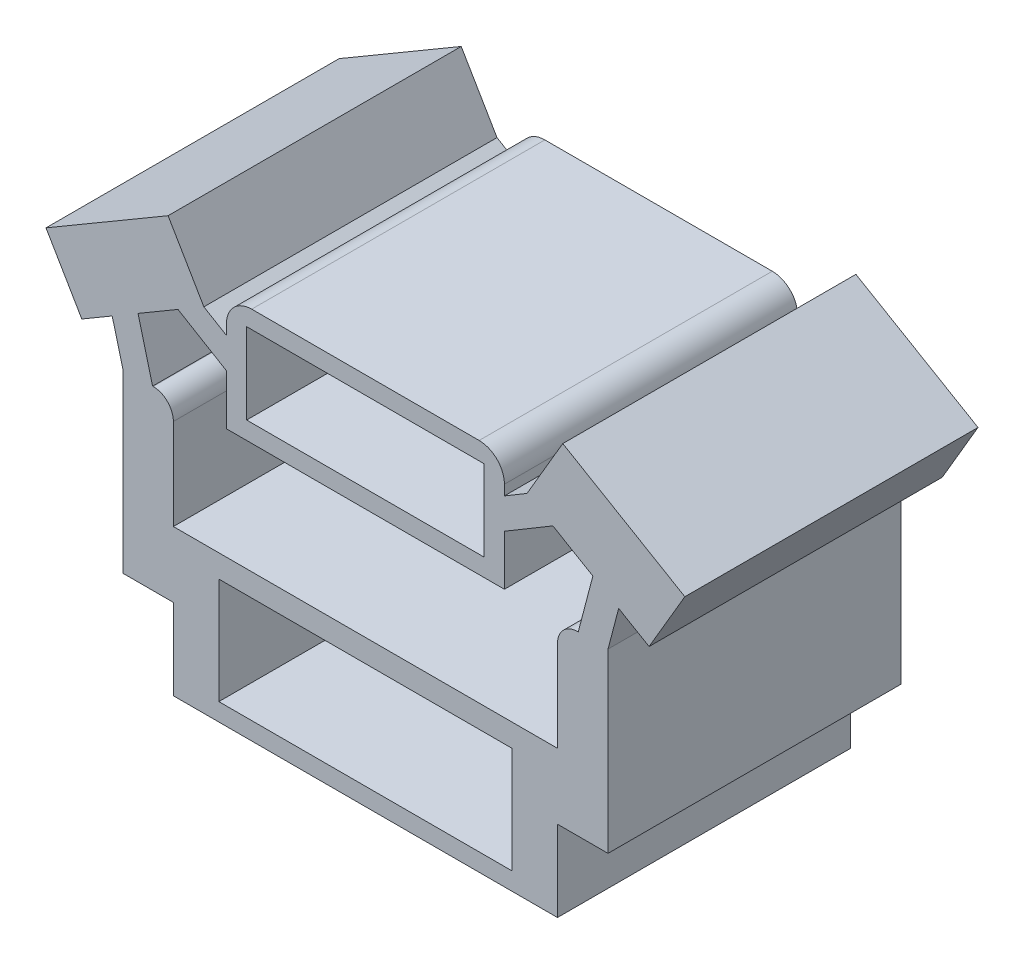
ISO-10303-21;
HEADER;
FILE_DESCRIPTION(('STEP AP214'),'2;1');
FILE_NAME('part.step','',(''),(''),'','','');
FILE_SCHEMA(('AUTOMOTIVE_DESIGN { 1 0 10303 214 1 1 1 1 }'));
ENDSEC;
DATA;
#1=APPLICATION_CONTEXT('core data for automotive mechanical design processes');
#2=APPLICATION_PROTOCOL_DEFINITION('international standard','automotive_design',2000,#1);
#3=PRODUCT_CONTEXT('',#1,'mechanical');
#4=PRODUCT('Part','Part','',(#3));
#5=PRODUCT_RELATED_PRODUCT_CATEGORY('part','',(#4));
#6=PRODUCT_DEFINITION_FORMATION('','',#4);
#7=PRODUCT_DEFINITION_CONTEXT('part definition',#1,'design');
#8=PRODUCT_DEFINITION('design','',#6,#7);
#9=PRODUCT_DEFINITION_SHAPE('','',#8);
#10=(LENGTH_UNIT() NAMED_UNIT(*) SI_UNIT(.MILLI.,.METRE.));
#11=(NAMED_UNIT(*) PLANE_ANGLE_UNIT() SI_UNIT($,.RADIAN.));
#12=(NAMED_UNIT(*) SI_UNIT($,.STERADIAN.) SOLID_ANGLE_UNIT());
#13=UNCERTAINTY_MEASURE_WITH_UNIT(LENGTH_MEASURE(1.E-05),#10,'distance_accuracy_value','');
#14=(GEOMETRIC_REPRESENTATION_CONTEXT(3) GLOBAL_UNCERTAINTY_ASSIGNED_CONTEXT((#13)) GLOBAL_UNIT_ASSIGNED_CONTEXT((#10,
#11,#12)) REPRESENTATION_CONTEXT('',''));
#15=CARTESIAN_POINT('',(0.,0.,0.));
#16=DIRECTION('',(0.,0.,1.));
#17=DIRECTION('',(1.,0.,0.));
#18=AXIS2_PLACEMENT_3D('',#15,#16,#17);
#19=CARTESIAN_POINT('',(3.8,1.4,5.8));
#20=DIRECTION('',(1.,0.,0.));
#21=DIRECTION('',(0.,0.,-1.));
#22=AXIS2_PLACEMENT_3D('',#19,#20,#21);
#23=PLANE('',#22);
#24=DIRECTION('',(0.,-1.,0.));
#25=VECTOR('',#24,1.);
#26=CARTESIAN_POINT('',(3.8,1.4,5.8));
#27=LINE('',#26,#25);
#28=CARTESIAN_POINT('',(3.8,3.2,5.8));
#29=VERTEX_POINT('',#28);
#30=CARTESIAN_POINT('',(3.8,1.4,5.8));
#31=VERTEX_POINT('',#30);
#32=EDGE_CURVE('E546',#29,#31,#27,.T.);
#33=ORIENTED_EDGE('',*,*,#32,.F.);
#34=DIRECTION('',(0.,0.,-1.));
#35=VECTOR('',#34,1.);
#36=CARTESIAN_POINT('',(3.8,3.2,5.8));
#37=LINE('',#36,#35);
#38=CARTESIAN_POINT('',(3.8,3.2,0.));
#39=VERTEX_POINT('',#38);
#40=EDGE_CURVE('E45',#29,#39,#37,.T.);
#41=ORIENTED_EDGE('',*,*,#40,.T.);
#42=DIRECTION('',(0.,-1.,0.));
#43=VECTOR('',#42,1.);
#44=CARTESIAN_POINT('',(3.8,1.4,0.));
#45=LINE('',#44,#43);
#46=CARTESIAN_POINT('',(3.8,1.4,0.));
#47=VERTEX_POINT('',#46);
#48=EDGE_CURVE('E545',#39,#47,#45,.T.);
#49=ORIENTED_EDGE('',*,*,#48,.T.);
#50=DIRECTION('',(0.,0.,-1.));
#51=VECTOR('',#50,1.);
#52=CARTESIAN_POINT('',(3.8,1.4,5.8));
#53=LINE('',#52,#51);
#54=EDGE_CURVE('E674',#31,#47,#53,.T.);
#55=ORIENTED_EDGE('',*,*,#54,.F.);
#56=EDGE_LOOP('',(#33,#41,#49,#55));
#57=FACE_BOUND('',#56,.T.);
#58=ADVANCED_FACE('F37',(#57),#23,.F.);
#59=CARTESIAN_POINT('',(-3.8,1.4,5.8));
#60=DIRECTION('',(0.,-1.,0.));
#61=DIRECTION('',(1.,0.,0.));
#62=AXIS2_PLACEMENT_3D('',#59,#60,#61);
#63=PLANE('',#62);
#64=DIRECTION('',(-1.,0.,0.));
#65=VECTOR('',#64,1.);
#66=CARTESIAN_POINT('',(-3.8,1.4,0.));
#67=LINE('',#66,#65);
#68=CARTESIAN_POINT('',(-3.8,1.4,0.));
#69=VERTEX_POINT('',#68);
#70=EDGE_CURVE('E588',#47,#69,#67,.T.);
#71=ORIENTED_EDGE('',*,*,#70,.T.);
#72=DIRECTION('',(0.,0.,-1.));
#73=VECTOR('',#72,1.);
#74=CARTESIAN_POINT('',(-3.8,1.4,5.8));
#75=LINE('',#74,#73);
#76=CARTESIAN_POINT('',(-3.8,1.4,5.8));
#77=VERTEX_POINT('',#76);
#78=EDGE_CURVE('E671',#77,#69,#75,.T.);
#79=ORIENTED_EDGE('',*,*,#78,.F.);
#80=DIRECTION('',(-1.,0.,0.));
#81=VECTOR('',#80,1.);
#82=CARTESIAN_POINT('',(-3.8,1.4,5.8));
#83=LINE('',#82,#81);
#84=EDGE_CURVE('E548',#31,#77,#83,.T.);
#85=ORIENTED_EDGE('',*,*,#84,.F.);
#86=ORIENTED_EDGE('',*,*,#54,.T.);
#87=EDGE_LOOP('',(#71,#79,#85,#86));
#88=FACE_BOUND('',#87,.T.);
#89=ADVANCED_FACE('F721',(#88),#63,.F.);
#90=CARTESIAN_POINT('',(-3.8,-1.4,5.8));
#91=DIRECTION('',(1.,0.,0.));
#92=DIRECTION('',(0.,0.,-1.));
#93=AXIS2_PLACEMENT_3D('',#90,#91,#92);
#94=PLANE('',#93);
#95=DIRECTION('',(0.,-1.,0.));
#96=VECTOR('',#95,1.);
#97=CARTESIAN_POINT('',(-3.8,-1.4,5.8));
#98=LINE('',#97,#96);
#99=CARTESIAN_POINT('',(-3.8,0.1,5.8));
#100=VERTEX_POINT('',#99);
#101=CARTESIAN_POINT('',(-3.8,-1.5,5.8));
#102=VERTEX_POINT('',#101);
#103=EDGE_CURVE('E552',#100,#102,#98,.T.);
#104=ORIENTED_EDGE('',*,*,#103,.F.);
#105=DIRECTION('',(0.,0.,-1.));
#106=VECTOR('',#105,1.);
#107=CARTESIAN_POINT('',(-3.8,0.1,5.8));
#108=LINE('',#107,#106);
#109=CARTESIAN_POINT('',(-3.8,0.1,0.));
#110=VERTEX_POINT('',#109);
#111=EDGE_CURVE('E483',#100,#110,#108,.T.);
#112=ORIENTED_EDGE('',*,*,#111,.T.);
#113=DIRECTION('',(0.,-1.,0.));
#114=VECTOR('',#113,1.);
#115=CARTESIAN_POINT('',(-3.8,-1.4,0.));
#116=LINE('',#115,#114);
#117=CARTESIAN_POINT('',(-3.8,-1.5,0.));
#118=VERTEX_POINT('',#117);
#119=EDGE_CURVE('E591',#110,#118,#116,.T.);
#120=ORIENTED_EDGE('',*,*,#119,.T.);
#121=DIRECTION('',(0.,0.,1.));
#122=VECTOR('',#121,1.);
#123=CARTESIAN_POINT('',(-3.8,-1.5,-7.60065786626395));
#124=LINE('',#123,#122);
#125=EDGE_CURVE('E383',#118,#102,#124,.T.);
#126=ORIENTED_EDGE('',*,*,#125,.T.);
#127=EDGE_LOOP('',(#104,#112,#120,#126));
#128=FACE_BOUND('',#127,.T.);
#129=ADVANCED_FACE('F784',(#128),#94,.F.);
#130=CARTESIAN_POINT('',(3.8,-1.4,5.8));
#131=DIRECTION('',(-1.,0.,0.));
#132=DIRECTION('',(0.,0.,1.));
#133=AXIS2_PLACEMENT_3D('',#130,#131,#132);
#134=PLANE('',#133);
#135=DIRECTION('',(0.,1.,0.));
#136=VECTOR('',#135,1.);
#137=CARTESIAN_POINT('',(3.8,-1.4,0.));
#138=LINE('',#137,#136);
#139=CARTESIAN_POINT('',(3.8,-1.5,0.));
#140=VERTEX_POINT('',#139);
#141=CARTESIAN_POINT('',(3.8,0.1,0.));
#142=VERTEX_POINT('',#141);
#143=EDGE_CURVE('E593',#140,#142,#138,.T.);
#144=ORIENTED_EDGE('',*,*,#143,.T.);
#145=DIRECTION('',(0.,0.,-1.));
#146=VECTOR('',#145,1.);
#147=CARTESIAN_POINT('',(3.8,0.1,5.8));
#148=LINE('',#147,#146);
#149=CARTESIAN_POINT('',(3.8,0.1,5.8));
#150=VERTEX_POINT('',#149);
#151=EDGE_CURVE('E668',#150,#142,#148,.T.);
#152=ORIENTED_EDGE('',*,*,#151,.F.);
#153=DIRECTION('',(0.,1.,0.));
#154=VECTOR('',#153,1.);
#155=CARTESIAN_POINT('',(3.8,-1.4,5.8));
#156=LINE('',#155,#154);
#157=CARTESIAN_POINT('',(3.8,-1.5,5.8));
#158=VERTEX_POINT('',#157);
#159=EDGE_CURVE('E554',#158,#150,#156,.T.);
#160=ORIENTED_EDGE('',*,*,#159,.F.);
#161=DIRECTION('',(0.,0.,1.));
#162=VECTOR('',#161,1.);
#163=CARTESIAN_POINT('',(3.8,-1.5,-7.60065786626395));
#164=LINE('',#163,#162);
#165=EDGE_CURVE('E380',#140,#158,#164,.T.);
#166=ORIENTED_EDGE('',*,*,#165,.F.);
#167=EDGE_LOOP('',(#144,#152,#160,#166));
#168=FACE_BOUND('',#167,.T.);
#169=ADVANCED_FACE('F857',(#168),#134,.F.);
#170=CARTESIAN_POINT('',(3.8,0.1,5.8));
#171=DIRECTION('',(0.,1.,0.));
#172=DIRECTION('',(0.,0.,1.));
#173=AXIS2_PLACEMENT_3D('',#170,#171,#172);
#174=PLANE('',#173);
#175=DIRECTION('',(1.,0.,0.));
#176=VECTOR('',#175,1.);
#177=CARTESIAN_POINT('',(3.8,0.1,0.));
#178=LINE('',#177,#176);
#179=CARTESIAN_POINT('',(4.8,0.1,0.));
#180=VERTEX_POINT('',#179);
#181=EDGE_CURVE('E595',#142,#180,#178,.T.);
#182=ORIENTED_EDGE('',*,*,#181,.T.);
#183=DIRECTION('',(0.,0.,-1.));
#184=VECTOR('',#183,1.);
#185=CARTESIAN_POINT('',(4.8,0.1,5.8));
#186=LINE('',#185,#184);
#187=CARTESIAN_POINT('',(4.8,0.1,5.8));
#188=VERTEX_POINT('',#187);
#189=EDGE_CURVE('E665',#188,#180,#186,.T.);
#190=ORIENTED_EDGE('',*,*,#189,.F.);
#191=DIRECTION('',(1.,0.,0.));
#192=VECTOR('',#191,1.);
#193=CARTESIAN_POINT('',(3.8,0.1,5.8));
#194=LINE('',#193,#192);
#195=EDGE_CURVE('E556',#150,#188,#194,.T.);
#196=ORIENTED_EDGE('',*,*,#195,.F.);
#197=ORIENTED_EDGE('',*,*,#151,.T.);
#198=EDGE_LOOP('',(#182,#190,#196,#197));
#199=FACE_BOUND('',#198,.T.);
#200=ADVANCED_FACE('F853',(#199),#174,.F.);
#201=CARTESIAN_POINT('',(4.8,3.6,5.8));
#202=DIRECTION('',(-1.,0.,0.));
#203=DIRECTION('',(0.,-1.,0.));
#204=AXIS2_PLACEMENT_3D('',#201,#202,#203);
#205=PLANE('',#204);
#206=DIRECTION('',(0.,1.,0.));
#207=VECTOR('',#206,1.);
#208=CARTESIAN_POINT('',(4.8,3.6,0.));
#209=LINE('',#208,#207);
#210=CARTESIAN_POINT('',(4.8,3.6,0.));
#211=VERTEX_POINT('',#210);
#212=EDGE_CURVE('E597',#180,#211,#209,.T.);
#213=ORIENTED_EDGE('',*,*,#212,.T.);
#214=DIRECTION('',(0.,0.,-1.));
#215=VECTOR('',#214,1.);
#216=CARTESIAN_POINT('',(4.8,3.6,5.8));
#217=LINE('',#216,#215);
#218=CARTESIAN_POINT('',(4.8,3.6,5.8));
#219=VERTEX_POINT('',#218);
#220=EDGE_CURVE('E662',#219,#211,#217,.T.);
#221=ORIENTED_EDGE('',*,*,#220,.F.);
#222=DIRECTION('',(0.,1.,0.));
#223=VECTOR('',#222,1.);
#224=CARTESIAN_POINT('',(4.8,3.6,5.8));
#225=LINE('',#224,#223);
#226=EDGE_CURVE('E558',#188,#219,#225,.T.);
#227=ORIENTED_EDGE('',*,*,#226,.F.);
#228=ORIENTED_EDGE('',*,*,#189,.T.);
#229=EDGE_LOOP('',(#213,#221,#227,#228));
#230=FACE_BOUND('',#229,.T.);
#231=ADVANCED_FACE('F847',(#230),#205,.F.);
#232=CARTESIAN_POINT('',(4.8,3.6,5.8));
#233=DIRECTION('',(-0.967267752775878,0.253757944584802,0.));
#234=DIRECTION('',(-0.253757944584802,-0.967267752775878,0.));
#235=AXIS2_PLACEMENT_3D('',#232,#233,#234);
#236=PLANE('',#235);
#237=DIRECTION('',(0.253757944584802,0.967267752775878,0.));
#238=VECTOR('',#237,1.);
#239=CARTESIAN_POINT('',(4.8,3.6,0.));
#240=LINE('',#239,#238);
#241=CARTESIAN_POINT('',(5.01061909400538,4.40283223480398,0.));
#242=VERTEX_POINT('',#241);
#243=EDGE_CURVE('E599',#211,#242,#240,.T.);
#244=ORIENTED_EDGE('',*,*,#243,.T.);
#245=DIRECTION('',(0.,0.,-1.));
#246=VECTOR('',#245,1.);
#247=CARTESIAN_POINT('',(5.01061909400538,4.40283223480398,5.8));
#248=LINE('',#247,#246);
#249=CARTESIAN_POINT('',(5.01061909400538,4.40283223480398,5.8));
#250=VERTEX_POINT('',#249);
#251=EDGE_CURVE('E659',#250,#242,#248,.T.);
#252=ORIENTED_EDGE('',*,*,#251,.F.);
#253=DIRECTION('',(0.253757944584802,0.967267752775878,0.));
#254=VECTOR('',#253,1.);
#255=CARTESIAN_POINT('',(4.8,3.6,5.8));
#256=LINE('',#255,#254);
#257=EDGE_CURVE('E560',#219,#250,#256,.T.);
#258=ORIENTED_EDGE('',*,*,#257,.F.);
#259=ORIENTED_EDGE('',*,*,#220,.T.);
#260=EDGE_LOOP('',(#244,#252,#258,#259));
#261=FACE_BOUND('',#260,.T.);
#262=ADVANCED_FACE('F843',(#261),#236,.F.);
#263=CARTESIAN_POINT('',(5.01061909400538,4.40283223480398,5.8));
#264=DIRECTION('',(0.505745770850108,0.862682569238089,0.));
#265=DIRECTION('',(-0.862682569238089,0.505745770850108,0.));
#266=AXIS2_PLACEMENT_3D('',#263,#264,#265);
#267=PLANE('',#266);
#268=DIRECTION('',(0.862682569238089,-0.505745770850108,0.));
#269=VECTOR('',#268,1.);
#270=CARTESIAN_POINT('',(5.01061909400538,4.40283223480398,0.));
#271=LINE('',#270,#269);
#272=CARTESIAN_POINT('',(5.61217034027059,4.0501741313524,0.));
#273=VERTEX_POINT('',#272);
#274=EDGE_CURVE('E601',#242,#273,#271,.T.);
#275=ORIENTED_EDGE('',*,*,#274,.T.);
#276=DIRECTION('',(0.,0.,-1.));
#277=VECTOR('',#276,1.);
#278=CARTESIAN_POINT('',(5.61217034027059,4.0501741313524,5.8));
#279=LINE('',#278,#277);
#280=CARTESIAN_POINT('',(5.61217034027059,4.0501741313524,5.8));
#281=VERTEX_POINT('',#280);
#282=EDGE_CURVE('E656',#281,#273,#279,.T.);
#283=ORIENTED_EDGE('',*,*,#282,.F.);
#284=DIRECTION('',(0.862682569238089,-0.505745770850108,0.));
#285=VECTOR('',#284,1.);
#286=CARTESIAN_POINT('',(5.01061909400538,4.40283223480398,5.8));
#287=LINE('',#286,#285);
#288=EDGE_CURVE('E562',#250,#281,#287,.T.);
#289=ORIENTED_EDGE('',*,*,#288,.F.);
#290=ORIENTED_EDGE('',*,*,#251,.T.);
#291=EDGE_LOOP('',(#275,#283,#289,#290));
#292=FACE_BOUND('',#291,.T.);
#293=ADVANCED_FACE('F838',(#292),#267,.F.);
#294=CARTESIAN_POINT('',(5.61217034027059,4.0501741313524,5.8));
#295=DIRECTION('',(-0.862682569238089,0.505745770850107,0.));
#296=DIRECTION('',(-0.505745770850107,-0.862682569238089,0.));
#297=AXIS2_PLACEMENT_3D('',#294,#295,#296);
#298=PLANE('',#297);
#299=DIRECTION('',(0.505745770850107,0.862682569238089,0.));
#300=VECTOR('',#299,1.);
#301=CARTESIAN_POINT('',(5.61217034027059,4.0501741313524,0.));
#302=LINE('',#301,#300);
#303=CARTESIAN_POINT('',(6.32021441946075,5.25792972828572,0.));
#304=VERTEX_POINT('',#303);
#305=EDGE_CURVE('E603',#273,#304,#302,.T.);
#306=ORIENTED_EDGE('',*,*,#305,.T.);
#307=DIRECTION('',(0.,0.,-1.));
#308=VECTOR('',#307,1.);
#309=CARTESIAN_POINT('',(6.32021441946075,5.25792972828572,5.8));
#310=LINE('',#309,#308);
#311=CARTESIAN_POINT('',(6.32021441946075,5.25792972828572,5.8));
#312=VERTEX_POINT('',#311);
#313=EDGE_CURVE('E653',#312,#304,#310,.T.);
#314=ORIENTED_EDGE('',*,*,#313,.F.);
#315=DIRECTION('',(0.505745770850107,0.862682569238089,0.));
#316=VECTOR('',#315,1.);
#317=CARTESIAN_POINT('',(5.61217034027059,4.0501741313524,5.8));
#318=LINE('',#317,#316);
#319=EDGE_CURVE('E564',#281,#312,#318,.T.);
#320=ORIENTED_EDGE('',*,*,#319,.F.);
#321=ORIENTED_EDGE('',*,*,#282,.T.);
#322=EDGE_LOOP('',(#306,#314,#320,#321));
#323=FACE_BOUND('',#322,.T.);
#324=ADVANCED_FACE('F832',(#323),#298,.F.);
#325=CARTESIAN_POINT('',(3.90470322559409,6.67401788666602,5.8));
#326=DIRECTION('',(-0.505745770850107,-0.86268256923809,0.));
#327=DIRECTION('',(0.86268256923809,-0.505745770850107,0.));
#328=AXIS2_PLACEMENT_3D('',#325,#326,#327);
#329=PLANE('',#328);
#330=DIRECTION('',(-0.86268256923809,0.505745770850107,0.));
#331=VECTOR('',#330,1.);
#332=CARTESIAN_POINT('',(3.90470322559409,6.67401788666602,0.));
#333=LINE('',#332,#331);
#334=CARTESIAN_POINT('',(3.90470322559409,6.67401788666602,0.));
#335=VERTEX_POINT('',#334);
#336=EDGE_CURVE('E605',#304,#335,#333,.T.);
#337=ORIENTED_EDGE('',*,*,#336,.T.);
#338=DIRECTION('',(0.,0.,-1.));
#339=VECTOR('',#338,1.);
#340=CARTESIAN_POINT('',(3.90470322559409,6.67401788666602,5.8));
#341=LINE('',#340,#339);
#342=CARTESIAN_POINT('',(3.90470322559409,6.67401788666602,5.8));
#343=VERTEX_POINT('',#342);
#344=EDGE_CURVE('E650',#343,#335,#341,.T.);
#345=ORIENTED_EDGE('',*,*,#344,.F.);
#346=DIRECTION('',(-0.86268256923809,0.505745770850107,0.));
#347=VECTOR('',#346,1.);
#348=CARTESIAN_POINT('',(3.90470322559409,6.67401788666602,5.8));
#349=LINE('',#348,#347);
#350=EDGE_CURVE('E566',#312,#343,#349,.T.);
#351=ORIENTED_EDGE('',*,*,#350,.F.);
#352=ORIENTED_EDGE('',*,*,#313,.T.);
#353=EDGE_LOOP('',(#337,#345,#351,#352));
#354=FACE_BOUND('',#353,.T.);
#355=ADVANCED_FACE('F828',(#354),#329,.F.);
#356=CARTESIAN_POINT('',(3.90470322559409,6.67401788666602,5.8));
#357=DIRECTION('',(0.86268256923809,-0.505745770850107,0.));
#358=DIRECTION('',(0.505745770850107,0.86268256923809,0.));
#359=AXIS2_PLACEMENT_3D('',#356,#357,#358);
#360=PLANE('',#359);
#361=DIRECTION('',(-0.505745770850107,-0.86268256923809,0.));
#362=VECTOR('',#361,1.);
#363=CARTESIAN_POINT('',(3.90470322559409,6.67401788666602,0.));
#364=LINE('',#363,#362);
#365=CARTESIAN_POINT('',(3.19665914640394,5.4662622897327,0.));
#366=VERTEX_POINT('',#365);
#367=EDGE_CURVE('E607',#335,#366,#364,.T.);
#368=ORIENTED_EDGE('',*,*,#367,.T.);
#369=DIRECTION('',(0.,0.,-1.));
#370=VECTOR('',#369,1.);
#371=CARTESIAN_POINT('',(3.19665914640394,5.4662622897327,5.8));
#372=LINE('',#371,#370);
#373=CARTESIAN_POINT('',(3.19665914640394,5.4662622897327,5.8));
#374=VERTEX_POINT('',#373);
#375=EDGE_CURVE('E647',#374,#366,#372,.T.);
#376=ORIENTED_EDGE('',*,*,#375,.F.);
#377=DIRECTION('',(-0.505745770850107,-0.86268256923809,0.));
#378=VECTOR('',#377,1.);
#379=CARTESIAN_POINT('',(3.90470322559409,6.67401788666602,5.8));
#380=LINE('',#379,#378);
#381=EDGE_CURVE('E568',#343,#374,#380,.T.);
#382=ORIENTED_EDGE('',*,*,#381,.F.);
#383=ORIENTED_EDGE('',*,*,#344,.T.);
#384=EDGE_LOOP('',(#368,#376,#382,#383));
#385=FACE_BOUND('',#384,.T.);
#386=ADVANCED_FACE('F823',(#385),#360,.F.);
#387=CARTESIAN_POINT('',(2.75,5.2,5.8));
#388=DIRECTION('',(0.512042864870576,-0.858959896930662,0.));
#389=DIRECTION('',(0.858959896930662,0.512042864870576,0.));
#390=AXIS2_PLACEMENT_3D('',#387,#388,#389);
#391=PLANE('',#390);
#392=DIRECTION('',(-0.858959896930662,-0.512042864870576,0.));
#393=VECTOR('',#392,1.);
#394=CARTESIAN_POINT('',(2.75,5.2,0.));
#395=LINE('',#394,#393);
#396=CARTESIAN_POINT('',(2.75,5.2,0.));
#397=VERTEX_POINT('',#396);
#398=EDGE_CURVE('E609',#366,#397,#395,.T.);
#399=ORIENTED_EDGE('',*,*,#398,.T.);
#400=DIRECTION('',(0.,0.,-1.));
#401=VECTOR('',#400,1.);
#402=CARTESIAN_POINT('',(2.75,5.2,5.8));
#403=LINE('',#402,#401);
#404=CARTESIAN_POINT('',(2.75,5.2,5.8));
#405=VERTEX_POINT('',#404);
#406=EDGE_CURVE('E644',#405,#397,#403,.T.);
#407=ORIENTED_EDGE('',*,*,#406,.F.);
#408=DIRECTION('',(-0.858959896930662,-0.512042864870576,0.));
#409=VECTOR('',#408,1.);
#410=CARTESIAN_POINT('',(2.75,5.2,5.8));
#411=LINE('',#410,#409);
#412=EDGE_CURVE('E570',#374,#405,#411,.T.);
#413=ORIENTED_EDGE('',*,*,#412,.F.);
#414=ORIENTED_EDGE('',*,*,#375,.T.);
#415=EDGE_LOOP('',(#399,#407,#413,#414));
#416=FACE_BOUND('',#415,.T.);
#417=ADVANCED_FACE('F817',(#416),#391,.F.);
#418=CARTESIAN_POINT('',(-2.75,5.2,5.8));
#419=DIRECTION('',(1.,0.,0.));
#420=DIRECTION('',(0.,0.,-1.));
#421=AXIS2_PLACEMENT_3D('',#418,#419,#420);
#422=PLANE('',#421);
#423=DIRECTION('',(0.,-1.,0.));
#424=VECTOR('',#423,1.);
#425=CARTESIAN_POINT('',(-2.75,5.2,5.8));
#426=LINE('',#425,#424);
#427=CARTESIAN_POINT('',(-2.75,4.5946166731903,5.8));
#428=VERTEX_POINT('',#427);
#429=CARTESIAN_POINT('',(-2.75,3.6,5.8));
#430=VERTEX_POINT('',#429);
#431=EDGE_CURVE('E572',#428,#430,#426,.T.);
#432=ORIENTED_EDGE('',*,*,#431,.F.);
#433=DIRECTION('',(0.,0.,-1.));
#434=VECTOR('',#433,1.);
#435=CARTESIAN_POINT('',(-2.75,4.5946166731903,5.8));
#436=LINE('',#435,#434);
#437=CARTESIAN_POINT('',(-2.75,4.5946166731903,0.));
#438=VERTEX_POINT('',#437);
#439=EDGE_CURVE('E536',#428,#438,#436,.T.);
#440=ORIENTED_EDGE('',*,*,#439,.T.);
#441=DIRECTION('',(0.,-1.,0.));
#442=VECTOR('',#441,1.);
#443=CARTESIAN_POINT('',(-2.75,5.2,0.));
#444=LINE('',#443,#442);
#445=CARTESIAN_POINT('',(-2.75,3.6,0.));
#446=VERTEX_POINT('',#445);
#447=EDGE_CURVE('E611',#438,#446,#444,.T.);
#448=ORIENTED_EDGE('',*,*,#447,.T.);
#449=DIRECTION('',(0.,0.,-1.));
#450=VECTOR('',#449,1.);
#451=CARTESIAN_POINT('',(-2.75,3.6,5.8));
#452=LINE('',#451,#450);
#453=EDGE_CURVE('E638',#430,#446,#452,.T.);
#454=ORIENTED_EDGE('',*,*,#453,.F.);
#455=EDGE_LOOP('',(#432,#440,#448,#454));
#456=FACE_BOUND('',#455,.T.);
#457=ADVANCED_FACE('F751',(#456),#422,.F.);
#458=CARTESIAN_POINT('',(-2.75,3.6,5.8));
#459=DIRECTION('',(0.,1.,0.));
#460=DIRECTION('',(0.,0.,1.));
#461=AXIS2_PLACEMENT_3D('',#458,#459,#460);
#462=PLANE('',#461);
#463=DIRECTION('',(1.,0.,0.));
#464=VECTOR('',#463,1.);
#465=CARTESIAN_POINT('',(-2.75,3.6,0.));
#466=LINE('',#465,#464);
#467=CARTESIAN_POINT('',(2.75,3.6,0.));
#468=VERTEX_POINT('',#467);
#469=EDGE_CURVE('E613',#446,#468,#466,.T.);
#470=ORIENTED_EDGE('',*,*,#469,.T.);
#471=DIRECTION('',(0.,0.,-1.));
#472=VECTOR('',#471,1.);
#473=CARTESIAN_POINT('',(2.75,3.6,5.8));
#474=LINE('',#473,#472);
#475=CARTESIAN_POINT('',(2.75,3.6,5.8));
#476=VERTEX_POINT('',#475);
#477=EDGE_CURVE('E635',#476,#468,#474,.T.);
#478=ORIENTED_EDGE('',*,*,#477,.F.);
#479=DIRECTION('',(1.,0.,0.));
#480=VECTOR('',#479,1.);
#481=CARTESIAN_POINT('',(-2.75,3.6,5.8));
#482=LINE('',#481,#480);
#483=EDGE_CURVE('E574',#430,#476,#482,.T.);
#484=ORIENTED_EDGE('',*,*,#483,.F.);
#485=ORIENTED_EDGE('',*,*,#453,.T.);
#486=EDGE_LOOP('',(#470,#478,#484,#485));
#487=FACE_BOUND('',#486,.T.);
#488=ADVANCED_FACE('F754',(#487),#462,.F.);
#489=CARTESIAN_POINT('',(2.75,4.5946166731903,5.8));
#490=DIRECTION('',(-1.,0.,0.));
#491=DIRECTION('',(0.,0.,1.));
#492=AXIS2_PLACEMENT_3D('',#489,#490,#491);
#493=PLANE('',#492);
#494=DIRECTION('',(0.,1.,0.));
#495=VECTOR('',#494,1.);
#496=CARTESIAN_POINT('',(2.75,4.5946166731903,0.));
#497=LINE('',#496,#495);
#498=CARTESIAN_POINT('',(2.75,4.5946166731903,0.));
#499=VERTEX_POINT('',#498);
#500=EDGE_CURVE('E615',#468,#499,#497,.T.);
#501=ORIENTED_EDGE('',*,*,#500,.T.);
#502=DIRECTION('',(0.,0.,-1.));
#503=VECTOR('',#502,1.);
#504=CARTESIAN_POINT('',(2.75,4.5946166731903,5.8));
#505=LINE('',#504,#503);
#506=CARTESIAN_POINT('',(2.75,4.5946166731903,5.8));
#507=VERTEX_POINT('',#506);
#508=EDGE_CURVE('E632',#507,#499,#505,.T.);
#509=ORIENTED_EDGE('',*,*,#508,.F.);
#510=DIRECTION('',(0.,1.,0.));
#511=VECTOR('',#510,1.);
#512=CARTESIAN_POINT('',(2.75,4.5946166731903,5.8));
#513=LINE('',#512,#511);
#514=EDGE_CURVE('E576',#476,#507,#513,.T.);
#515=ORIENTED_EDGE('',*,*,#514,.F.);
#516=ORIENTED_EDGE('',*,*,#477,.T.);
#517=EDGE_LOOP('',(#501,#509,#515,#516));
#518=FACE_BOUND('',#517,.T.);
#519=ADVANCED_FACE('F759',(#518),#493,.F.);
#520=CARTESIAN_POINT('',(2.75,4.5946166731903,5.8));
#521=DIRECTION('',(-0.512042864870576,0.858959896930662,0.));
#522=DIRECTION('',(-0.858959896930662,-0.512042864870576,0.));
#523=AXIS2_PLACEMENT_3D('',#520,#521,#522);
#524=PLANE('',#523);
#525=DIRECTION('',(0.858959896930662,0.512042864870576,0.));
#526=VECTOR('',#525,1.);
#527=CARTESIAN_POINT('',(2.75,4.5946166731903,0.));
#528=LINE('',#527,#526);
#529=CARTESIAN_POINT('',(3.70866861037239,5.16609786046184,0.));
#530=VERTEX_POINT('',#529);
#531=EDGE_CURVE('E617',#499,#530,#528,.T.);
#532=ORIENTED_EDGE('',*,*,#531,.T.);
#533=DIRECTION('',(0.,0.,-1.));
#534=VECTOR('',#533,1.);
#535=CARTESIAN_POINT('',(3.70866861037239,5.16609786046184,5.8));
#536=LINE('',#535,#534);
#537=CARTESIAN_POINT('',(3.70866861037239,5.16609786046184,5.8));
#538=VERTEX_POINT('',#537);
#539=EDGE_CURVE('E629',#538,#530,#536,.T.);
#540=ORIENTED_EDGE('',*,*,#539,.F.);
#541=DIRECTION('',(0.858959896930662,0.512042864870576,0.));
#542=VECTOR('',#541,1.);
#543=CARTESIAN_POINT('',(2.75,4.5946166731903,5.8));
#544=LINE('',#543,#542);
#545=EDGE_CURVE('E578',#507,#538,#544,.T.);
#546=ORIENTED_EDGE('',*,*,#545,.F.);
#547=ORIENTED_EDGE('',*,*,#508,.T.);
#548=EDGE_LOOP('',(#532,#540,#546,#547));
#549=FACE_BOUND('',#548,.T.);
#550=ADVANCED_FACE('F765',(#549),#524,.F.);
#551=CARTESIAN_POINT('',(3.70866861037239,5.16609786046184,5.8));
#552=DIRECTION('',(0.505745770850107,0.86268256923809,0.));
#553=DIRECTION('',(-0.86268256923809,0.505745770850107,0.));
#554=AXIS2_PLACEMENT_3D('',#551,#552,#553);
#555=PLANE('',#554);
#556=DIRECTION('',(0.86268256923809,-0.505745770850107,0.));
#557=VECTOR('',#556,1.);
#558=CARTESIAN_POINT('',(3.70866861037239,5.16609786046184,0.));
#559=LINE('',#558,#557);
#560=CARTESIAN_POINT('',(4.49988141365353,4.70225108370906,0.));
#561=VERTEX_POINT('',#560);
#562=EDGE_CURVE('E619',#530,#561,#559,.T.);
#563=ORIENTED_EDGE('',*,*,#562,.T.);
#564=DIRECTION('',(0.,0.,-1.));
#565=VECTOR('',#564,1.);
#566=CARTESIAN_POINT('',(4.49988141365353,4.70225108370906,5.8));
#567=LINE('',#566,#565);
#568=CARTESIAN_POINT('',(4.49988141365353,4.70225108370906,5.8));
#569=VERTEX_POINT('',#568);
#570=EDGE_CURVE('E626',#569,#561,#567,.T.);
#571=ORIENTED_EDGE('',*,*,#570,.F.);
#572=DIRECTION('',(0.86268256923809,-0.505745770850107,0.));
#573=VECTOR('',#572,1.);
#574=CARTESIAN_POINT('',(3.70866861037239,5.16609786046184,5.8));
#575=LINE('',#574,#573);
#576=EDGE_CURVE('E580',#538,#569,#575,.T.);
#577=ORIENTED_EDGE('',*,*,#576,.F.);
#578=ORIENTED_EDGE('',*,*,#539,.T.);
#579=EDGE_LOOP('',(#563,#571,#577,#578));
#580=FACE_BOUND('',#579,.T.);
#581=ADVANCED_FACE('F769',(#580),#555,.F.);
#582=CARTESIAN_POINT('',(4.21071125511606,3.6,5.8));
#583=DIRECTION('',(0.967267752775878,-0.253757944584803,0.));
#584=DIRECTION('',(0.253757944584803,0.967267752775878,0.));
#585=AXIS2_PLACEMENT_3D('',#582,#583,#584);
#586=PLANE('',#585);
#587=DIRECTION('',(-0.253757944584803,-0.967267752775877,0.));
#588=VECTOR('',#587,1.);
#589=CARTESIAN_POINT('',(4.21071125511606,3.6,0.));
#590=LINE('',#589,#588);
#591=CARTESIAN_POINT('',(4.21071125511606,3.6,0.));
#592=VERTEX_POINT('',#591);
#593=EDGE_CURVE('E621',#561,#592,#590,.T.);
#594=ORIENTED_EDGE('',*,*,#593,.T.);
#595=DIRECTION('',(0.,0.,-1.));
#596=VECTOR('',#595,1.);
#597=CARTESIAN_POINT('',(4.21071125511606,3.6,5.8));
#598=LINE('',#597,#596);
#599=CARTESIAN_POINT('',(4.21071125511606,3.6,5.8));
#600=VERTEX_POINT('',#599);
#601=EDGE_CURVE('E586',#600,#592,#598,.T.);
#602=ORIENTED_EDGE('',*,*,#601,.F.);
#603=DIRECTION('',(-0.253757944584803,-0.967267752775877,0.));
#604=VECTOR('',#603,1.);
#605=CARTESIAN_POINT('',(4.21071125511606,3.6,5.8));
#606=LINE('',#605,#604);
#607=EDGE_CURVE('E582',#569,#600,#606,.T.);
#608=ORIENTED_EDGE('',*,*,#607,.F.);
#609=ORIENTED_EDGE('',*,*,#570,.T.);
#610=EDGE_LOOP('',(#594,#602,#608,#609));
#611=FACE_BOUND('',#610,.T.);
#612=ADVANCED_FACE('F774',(#611),#586,.F.);
#613=CARTESIAN_POINT('',(3.8,3.6,5.8));
#614=DIRECTION('',(0.,-1.,0.));
#615=DIRECTION('',(0.,0.,-1.));
#616=AXIS2_PLACEMENT_3D('',#613,#614,#615);
#617=PLANE('',#616);
#618=DIRECTION('',(-1.,0.,0.));
#619=VECTOR('',#618,1.);
#620=CARTESIAN_POINT('',(3.8,3.6,0.));
#621=LINE('',#620,#619);
#622=CARTESIAN_POINT('',(4.2,3.6,0.));
#623=VERTEX_POINT('',#622);
#624=EDGE_CURVE('E549',#592,#623,#621,.T.);
#625=ORIENTED_EDGE('',*,*,#624,.T.);
#626=DIRECTION('',(0.,0.,-1.));
#627=VECTOR('',#626,1.);
#628=CARTESIAN_POINT('',(4.2,3.6,5.8));
#629=LINE('',#628,#627);
#630=CARTESIAN_POINT('',(4.2,3.6,5.8));
#631=VERTEX_POINT('',#630);
#632=EDGE_CURVE('E11',#623,#631,#629,.F.);
#633=ORIENTED_EDGE('',*,*,#632,.T.);
#634=DIRECTION('',(-1.,0.,0.));
#635=VECTOR('',#634,1.);
#636=CARTESIAN_POINT('',(3.8,3.6,5.8));
#637=LINE('',#636,#635);
#638=EDGE_CURVE('E584',#600,#631,#637,.T.);
#639=ORIENTED_EDGE('',*,*,#638,.F.);
#640=ORIENTED_EDGE('',*,*,#601,.T.);
#641=EDGE_LOOP('',(#625,#633,#639,#640));
#642=FACE_BOUND('',#641,.T.);
#643=ADVANCED_FACE('F966',(#642),#617,.F.);
#644=CARTESIAN_POINT('',(0.,0.,5.8));
#645=DIRECTION('',(0.,0.,-1.));
#646=DIRECTION('',(-1.,0.,0.));
#647=AXIS2_PLACEMENT_3D('',#644,#645,#646);
#648=PLANE('',#647);
#649=DIRECTION('',(1.,0.,0.));
#650=VECTOR('',#649,1.);
#651=CARTESIAN_POINT('',(-2.9,-1.15,5.8));
#652=LINE('',#651,#650);
#653=CARTESIAN_POINT('',(-2.9,-1.15,5.8));
#654=VERTEX_POINT('',#653);
#655=CARTESIAN_POINT('',(2.9,-1.15,5.8));
#656=VERTEX_POINT('',#655);
#657=EDGE_CURVE('E369',#654,#656,#652,.T.);
#658=ORIENTED_EDGE('',*,*,#657,.F.);
#659=DIRECTION('',(0.,-1.,0.));
#660=VECTOR('',#659,1.);
#661=CARTESIAN_POINT('',(-2.9,-1.05,5.8));
#662=LINE('',#661,#660);
#663=CARTESIAN_POINT('',(-2.9,0.95,5.8));
#664=VERTEX_POINT('',#663);
#665=EDGE_CURVE('E360',#664,#654,#662,.T.);
#666=ORIENTED_EDGE('',*,*,#665,.F.);
#667=DIRECTION('',(1.,0.,0.));
#668=VECTOR('',#667,1.);
#669=CARTESIAN_POINT('',(-2.9,0.95,5.8));
#670=LINE('',#669,#668);
#671=CARTESIAN_POINT('',(2.9,0.95,5.8));
#672=VERTEX_POINT('',#671);
#673=EDGE_CURVE('E386',#664,#672,#670,.T.);
#674=ORIENTED_EDGE('',*,*,#673,.T.);
#675=DIRECTION('',(0.,1.,0.));
#676=VECTOR('',#675,1.);
#677=CARTESIAN_POINT('',(2.9,-1.05,5.8));
#678=LINE('',#677,#676);
#679=EDGE_CURVE('E425',#656,#672,#678,.T.);
#680=ORIENTED_EDGE('',*,*,#679,.F.);
#681=EDGE_LOOP('',(#658,#666,#674,#680));
#682=FACE_BOUND('',#681,.T.);
#683=DIRECTION('',(1.,0.,0.));
#684=VECTOR('',#683,1.);
#685=CARTESIAN_POINT('',(2.35,5.55,5.8));
#686=LINE('',#685,#684);
#687=CARTESIAN_POINT('',(-2.35,5.55,5.8));
#688=VERTEX_POINT('',#687);
#689=CARTESIAN_POINT('',(2.35,5.55,5.8));
#690=VERTEX_POINT('',#689);
#691=EDGE_CURVE('E395',#688,#690,#686,.T.);
#692=ORIENTED_EDGE('',*,*,#691,.T.);
#693=DIRECTION('',(0.,1.,0.));
#694=VECTOR('',#693,1.);
#695=CARTESIAN_POINT('',(2.35,5.55,5.8));
#696=LINE('',#695,#694);
#697=CARTESIAN_POINT('',(2.35,3.95,5.8));
#698=VERTEX_POINT('',#697);
#699=EDGE_CURVE('E433',#698,#690,#696,.T.);
#700=ORIENTED_EDGE('',*,*,#699,.F.);
#701=DIRECTION('',(1.,0.,0.));
#702=VECTOR('',#701,1.);
#703=CARTESIAN_POINT('',(-2.35,3.95,5.8));
#704=LINE('',#703,#702);
#705=CARTESIAN_POINT('',(-2.35,3.95,5.8));
#706=VERTEX_POINT('',#705);
#707=EDGE_CURVE('E437',#706,#698,#704,.T.);
#708=ORIENTED_EDGE('',*,*,#707,.F.);
#709=DIRECTION('',(0.,-1.,0.));
#710=VECTOR('',#709,1.);
#711=CARTESIAN_POINT('',(-2.35,5.55000000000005,5.8));
#712=LINE('',#711,#710);
#713=EDGE_CURVE('E423',#688,#706,#712,.T.);
#714=ORIENTED_EDGE('',*,*,#713,.F.);
#715=EDGE_LOOP('',(#692,#700,#708,#714));
#716=FACE_BOUND('',#715,.T.);
#717=DIRECTION('',(-1.,0.,0.));
#718=VECTOR('',#717,1.);
#719=CARTESIAN_POINT('',(-2.75,5.9,5.8));
#720=LINE('',#719,#718);
#721=CARTESIAN_POINT('',(2.25,5.9,5.8));
#722=VERTEX_POINT('',#721);
#723=CARTESIAN_POINT('',(-2.25,5.9,5.8));
#724=VERTEX_POINT('',#723);
#725=EDGE_CURVE('E399',#722,#724,#720,.T.);
#726=ORIENTED_EDGE('',*,*,#725,.T.);
#727=CARTESIAN_POINT('',(-2.25,5.4,5.8));
#728=DIRECTION('',(0.,0.,-1.));
#729=DIRECTION('',(-1.,0.,0.));
#730=AXIS2_PLACEMENT_3D('',#727,#728,#729);
#731=CIRCLE('',#730,0.5);
#732=CARTESIAN_POINT('',(-2.75,5.4,5.8));
#733=VERTEX_POINT('',#732);
#734=EDGE_CURVE('E686',#724,#733,#731,.F.);
#735=ORIENTED_EDGE('',*,*,#734,.T.);
#736=DIRECTION('',(0.,-1.,0.));
#737=VECTOR('',#736,1.);
#738=CARTESIAN_POINT('',(-2.75,5.2,5.8));
#739=LINE('',#738,#737);
#740=CARTESIAN_POINT('',(-2.75,5.2,5.8));
#741=VERTEX_POINT('',#740);
#742=EDGE_CURVE('E396',#733,#741,#739,.T.);
#743=ORIENTED_EDGE('',*,*,#742,.T.);
#744=DIRECTION('',(0.858959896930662,-0.512042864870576,0.));
#745=VECTOR('',#744,1.);
#746=CARTESIAN_POINT('',(-2.75,5.2,5.8));
#747=LINE('',#746,#745);
#748=CARTESIAN_POINT('',(-3.19665914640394,5.4662622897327,5.8));
#749=VERTEX_POINT('',#748);
#750=EDGE_CURVE('E459',#749,#741,#747,.T.);
#751=ORIENTED_EDGE('',*,*,#750,.F.);
#752=DIRECTION('',(0.505745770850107,-0.86268256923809,0.));
#753=VECTOR('',#752,1.);
#754=CARTESIAN_POINT('',(-3.90470322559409,6.67401788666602,5.8));
#755=LINE('',#754,#753);
#756=CARTESIAN_POINT('',(-3.90470322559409,6.67401788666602,5.8));
#757=VERTEX_POINT('',#756);
#758=EDGE_CURVE('E462',#757,#749,#755,.T.);
#759=ORIENTED_EDGE('',*,*,#758,.F.);
#760=DIRECTION('',(0.86268256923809,0.505745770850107,0.));
#761=VECTOR('',#760,1.);
#762=CARTESIAN_POINT('',(-3.90470322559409,6.67401788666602,5.8));
#763=LINE('',#762,#761);
#764=CARTESIAN_POINT('',(-6.32021441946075,5.25792972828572,5.8));
#765=VERTEX_POINT('',#764);
#766=EDGE_CURVE('E465',#765,#757,#763,.T.);
#767=ORIENTED_EDGE('',*,*,#766,.F.);
#768=DIRECTION('',(-0.505745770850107,0.862682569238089,0.));
#769=VECTOR('',#768,1.);
#770=CARTESIAN_POINT('',(-5.61217034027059,4.0501741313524,5.8));
#771=LINE('',#770,#769);
#772=CARTESIAN_POINT('',(-5.61217034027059,4.0501741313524,5.8));
#773=VERTEX_POINT('',#772);
#774=EDGE_CURVE('E468',#773,#765,#771,.T.);
#775=ORIENTED_EDGE('',*,*,#774,.F.);
#776=DIRECTION('',(-0.862682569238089,-0.505745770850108,0.));
#777=VECTOR('',#776,1.);
#778=CARTESIAN_POINT('',(-5.01061909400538,4.40283223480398,5.8));
#779=LINE('',#778,#777);
#780=CARTESIAN_POINT('',(-5.01061909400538,4.40283223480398,5.8));
#781=VERTEX_POINT('',#780);
#782=EDGE_CURVE('E471',#781,#773,#779,.T.);
#783=ORIENTED_EDGE('',*,*,#782,.F.);
#784=DIRECTION('',(-0.253757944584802,0.967267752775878,0.));
#785=VECTOR('',#784,1.);
#786=CARTESIAN_POINT('',(-4.8,3.6,5.8));
#787=LINE('',#786,#785);
#788=CARTESIAN_POINT('',(-4.8,3.6,5.8));
#789=VERTEX_POINT('',#788);
#790=EDGE_CURVE('E474',#789,#781,#787,.T.);
#791=ORIENTED_EDGE('',*,*,#790,.F.);
#792=DIRECTION('',(0.,1.,0.));
#793=VECTOR('',#792,1.);
#794=CARTESIAN_POINT('',(-4.8,3.6,5.8));
#795=LINE('',#794,#793);
#796=CARTESIAN_POINT('',(-4.8,0.1,5.8));
#797=VERTEX_POINT('',#796);
#798=EDGE_CURVE('E477',#797,#789,#795,.T.);
#799=ORIENTED_EDGE('',*,*,#798,.F.);
#800=DIRECTION('',(-1.,0.,0.));
#801=VECTOR('',#800,1.);
#802=CARTESIAN_POINT('',(-3.8,0.1,5.8));
#803=LINE('',#802,#801);
#804=EDGE_CURVE('E480',#100,#797,#803,.T.);
#805=ORIENTED_EDGE('',*,*,#804,.F.);
#806=ORIENTED_EDGE('',*,*,#103,.T.);
#807=DIRECTION('',(1.,0.,0.));
#808=VECTOR('',#807,1.);
#809=CARTESIAN_POINT('',(-3.8,-1.5,5.8));
#810=LINE('',#809,#808);
#811=EDGE_CURVE('E373',#102,#158,#810,.T.);
#812=ORIENTED_EDGE('',*,*,#811,.T.);
#813=ORIENTED_EDGE('',*,*,#159,.T.);
#814=ORIENTED_EDGE('',*,*,#195,.T.);
#815=ORIENTED_EDGE('',*,*,#226,.T.);
#816=ORIENTED_EDGE('',*,*,#257,.T.);
#817=ORIENTED_EDGE('',*,*,#288,.T.);
#818=ORIENTED_EDGE('',*,*,#319,.T.);
#819=ORIENTED_EDGE('',*,*,#350,.T.);
#820=ORIENTED_EDGE('',*,*,#381,.T.);
#821=ORIENTED_EDGE('',*,*,#412,.T.);
#822=DIRECTION('',(0.,1.,0.));
#823=VECTOR('',#822,1.);
#824=CARTESIAN_POINT('',(2.75,5.9,5.8));
#825=LINE('',#824,#823);
#826=CARTESIAN_POINT('',(2.75,5.4,5.8));
#827=VERTEX_POINT('',#826);
#828=EDGE_CURVE('E402',#405,#827,#825,.T.);
#829=ORIENTED_EDGE('',*,*,#828,.T.);
#830=CARTESIAN_POINT('',(2.25,5.4,5.8));
#831=DIRECTION('',(0.,0.,-1.));
#832=DIRECTION('',(-1.,0.,0.));
#833=AXIS2_PLACEMENT_3D('',#830,#831,#832);
#834=CIRCLE('',#833,0.5);
#835=EDGE_CURVE('E684',#827,#722,#834,.F.);
#836=ORIENTED_EDGE('',*,*,#835,.T.);
#837=EDGE_LOOP('',(#726,#735,#743,#751,#759,#767,#775,#783,#791,#799,#805,#806,#812,#813,#814,
#815,#816,#817,#818,#819,#820,#821,#829,#836));
#838=FACE_BOUND('',#837,.T.);
#839=DIRECTION('',(0.,-1.,0.));
#840=VECTOR('',#839,1.);
#841=CARTESIAN_POINT('',(-3.8,1.4,5.8));
#842=LINE('',#841,#840);
#843=CARTESIAN_POINT('',(-3.8,3.2,5.8));
#844=VERTEX_POINT('',#843);
#845=EDGE_CURVE('E444',#844,#77,#842,.T.);
#846=ORIENTED_EDGE('',*,*,#845,.F.);
#847=CARTESIAN_POINT('',(-4.2,3.2,5.8));
#848=DIRECTION('',(0.,0.,-1.));
#849=DIRECTION('',(-1.,0.,0.));
#850=AXIS2_PLACEMENT_3D('',#847,#848,#849);
#851=CIRCLE('',#850,0.4);
#852=CARTESIAN_POINT('',(-4.2,3.6,5.8));
#853=VERTEX_POINT('',#852);
#854=EDGE_CURVE('E707',#844,#853,#851,.F.);
#855=ORIENTED_EDGE('',*,*,#854,.T.);
#856=DIRECTION('',(1.,0.,0.));
#857=VECTOR('',#856,1.);
#858=CARTESIAN_POINT('',(-3.8,3.6,5.8));
#859=LINE('',#858,#857);
#860=CARTESIAN_POINT('',(-4.21071125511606,3.6,5.8));
#861=VERTEX_POINT('',#860);
#862=EDGE_CURVE('E446',#861,#853,#859,.T.);
#863=ORIENTED_EDGE('',*,*,#862,.F.);
#864=DIRECTION('',(0.253757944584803,-0.967267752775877,0.));
#865=VECTOR('',#864,1.);
#866=CARTESIAN_POINT('',(-4.21071125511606,3.6,5.8));
#867=LINE('',#866,#865);
#868=CARTESIAN_POINT('',(-4.49988141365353,4.70225108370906,5.8));
#869=VERTEX_POINT('',#868);
#870=EDGE_CURVE('E450',#869,#861,#867,.T.);
#871=ORIENTED_EDGE('',*,*,#870,.F.);
#872=DIRECTION('',(-0.86268256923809,-0.505745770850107,0.));
#873=VECTOR('',#872,1.);
#874=CARTESIAN_POINT('',(-3.70866861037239,5.16609786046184,5.8));
#875=LINE('',#874,#873);
#876=CARTESIAN_POINT('',(-3.70866861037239,5.16609786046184,5.8));
#877=VERTEX_POINT('',#876);
#878=EDGE_CURVE('E453',#877,#869,#875,.T.);
#879=ORIENTED_EDGE('',*,*,#878,.F.);
#880=DIRECTION('',(-0.858959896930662,0.512042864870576,0.));
#881=VECTOR('',#880,1.);
#882=CARTESIAN_POINT('',(-2.75,4.5946166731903,5.8));
#883=LINE('',#882,#881);
#884=EDGE_CURVE('E456',#428,#877,#883,.T.);
#885=ORIENTED_EDGE('',*,*,#884,.F.);
#886=ORIENTED_EDGE('',*,*,#431,.T.);
#887=ORIENTED_EDGE('',*,*,#483,.T.);
#888=ORIENTED_EDGE('',*,*,#514,.T.);
#889=ORIENTED_EDGE('',*,*,#545,.T.);
#890=ORIENTED_EDGE('',*,*,#576,.T.);
#891=ORIENTED_EDGE('',*,*,#607,.T.);
#892=ORIENTED_EDGE('',*,*,#638,.T.);
#893=CARTESIAN_POINT('',(4.2,3.2,5.8));
#894=DIRECTION('',(0.,0.,-1.));
#895=DIRECTION('',(-1.,0.,0.));
#896=AXIS2_PLACEMENT_3D('',#893,#894,#895);
#897=CIRCLE('',#896,0.4);
#898=EDGE_CURVE('E52',#631,#29,#897,.F.);
#899=ORIENTED_EDGE('',*,*,#898,.T.);
#900=ORIENTED_EDGE('',*,*,#32,.T.);
#901=ORIENTED_EDGE('',*,*,#84,.T.);
#902=EDGE_LOOP('',(#846,#855,#863,#871,#879,#885,#886,#887,#888,#889,#890,#891,#892,#899,#900,#901));
#903=FACE_BOUND('',#902,.T.);
#904=ADVANCED_FACE('F723',(#682,#716,#838,#903),#648,.F.);
#905=CARTESIAN_POINT('',(0.,0.,0.));
#906=DIRECTION('',(0.,0.,-1.));
#907=DIRECTION('',(-1.,0.,0.));
#908=AXIS2_PLACEMENT_3D('',#905,#906,#907);
#909=PLANE('',#908);
#910=DIRECTION('',(0.,-1.,0.));
#911=VECTOR('',#910,1.);
#912=CARTESIAN_POINT('',(-2.9,-1.05,0.));
#913=LINE('',#912,#911);
#914=CARTESIAN_POINT('',(-2.9,0.95,0.));
#915=VERTEX_POINT('',#914);
#916=CARTESIAN_POINT('',(-2.9,-1.15,0.));
#917=VERTEX_POINT('',#916);
#918=EDGE_CURVE('E342',#915,#917,#913,.T.);
#919=ORIENTED_EDGE('',*,*,#918,.T.);
#920=DIRECTION('',(1.,0.,0.));
#921=VECTOR('',#920,1.);
#922=CARTESIAN_POINT('',(-2.9,-1.15,0.));
#923=LINE('',#922,#921);
#924=CARTESIAN_POINT('',(2.9,-1.15,0.));
#925=VERTEX_POINT('',#924);
#926=EDGE_CURVE('E348',#917,#925,#923,.T.);
#927=ORIENTED_EDGE('',*,*,#926,.T.);
#928=DIRECTION('',(0.,1.,0.));
#929=VECTOR('',#928,1.);
#930=CARTESIAN_POINT('',(2.9,-1.05,0.));
#931=LINE('',#930,#929);
#932=CARTESIAN_POINT('',(2.9,0.95,0.));
#933=VERTEX_POINT('',#932);
#934=EDGE_CURVE('E354',#925,#933,#931,.T.);
#935=ORIENTED_EDGE('',*,*,#934,.T.);
#936=DIRECTION('',(1.,0.,0.));
#937=VECTOR('',#936,1.);
#938=CARTESIAN_POINT('',(-2.9,0.95,0.));
#939=LINE('',#938,#937);
#940=EDGE_CURVE('E350',#915,#933,#939,.T.);
#941=ORIENTED_EDGE('',*,*,#940,.F.);
#942=EDGE_LOOP('',(#919,#927,#935,#941));
#943=FACE_BOUND('',#942,.T.);
#944=DIRECTION('',(0.,1.,0.));
#945=VECTOR('',#944,1.);
#946=CARTESIAN_POINT('',(2.35,5.55,0.));
#947=LINE('',#946,#945);
#948=CARTESIAN_POINT('',(2.35,3.95,0.));
#949=VERTEX_POINT('',#948);
#950=CARTESIAN_POINT('',(2.35,5.55,0.));
#951=VERTEX_POINT('',#950);
#952=EDGE_CURVE('E432',#949,#951,#947,.T.);
#953=ORIENTED_EDGE('',*,*,#952,.T.);
#954=DIRECTION('',(1.,0.,0.));
#955=VECTOR('',#954,1.);
#956=CARTESIAN_POINT('',(2.35,5.55,0.));
#957=LINE('',#956,#955);
#958=CARTESIAN_POINT('',(-2.35,5.55,0.));
#959=VERTEX_POINT('',#958);
#960=EDGE_CURVE('E398',#959,#951,#957,.T.);
#961=ORIENTED_EDGE('',*,*,#960,.F.);
#962=DIRECTION('',(0.,1.,0.));
#963=VECTOR('',#962,1.);
#964=CARTESIAN_POINT('',(-2.35,0.,0.));
#965=LINE('',#964,#963);
#966=CARTESIAN_POINT('',(-2.35,3.95,0.));
#967=VERTEX_POINT('',#966);
#968=EDGE_CURVE('E677',#967,#959,#965,.T.);
#969=ORIENTED_EDGE('',*,*,#968,.F.);
#970=DIRECTION('',(1.,0.,0.));
#971=VECTOR('',#970,1.);
#972=CARTESIAN_POINT('',(-2.35,3.95,0.));
#973=LINE('',#972,#971);
#974=EDGE_CURVE('E429',#967,#949,#973,.T.);
#975=ORIENTED_EDGE('',*,*,#974,.T.);
#976=EDGE_LOOP('',(#953,#961,#969,#975));
#977=FACE_BOUND('',#976,.T.);
#978=DIRECTION('',(0.,-1.,0.));
#979=VECTOR('',#978,1.);
#980=CARTESIAN_POINT('',(-2.75,5.2,0.));
#981=LINE('',#980,#979);
#982=CARTESIAN_POINT('',(-2.75,5.4,0.));
#983=VERTEX_POINT('',#982);
#984=CARTESIAN_POINT('',(-2.75,5.2,0.));
#985=VERTEX_POINT('',#984);
#986=EDGE_CURVE('E410',#983,#985,#981,.T.);
#987=ORIENTED_EDGE('',*,*,#986,.F.);
#988=CARTESIAN_POINT('',(-2.25,5.4,0.));
#989=DIRECTION('',(0.,0.,-1.));
#990=DIRECTION('',(-1.,0.,0.));
#991=AXIS2_PLACEMENT_3D('',#988,#989,#990);
#992=CIRCLE('',#991,0.5);
#993=CARTESIAN_POINT('',(-2.25,5.9,0.));
#994=VERTEX_POINT('',#993);
#995=EDGE_CURVE('E692',#983,#994,#992,.T.);
#996=ORIENTED_EDGE('',*,*,#995,.T.);
#997=DIRECTION('',(-1.,0.,0.));
#998=VECTOR('',#997,1.);
#999=CARTESIAN_POINT('',(-2.75,5.9,0.));
#1000=LINE('',#999,#998);
#1001=CARTESIAN_POINT('',(2.25,5.9,0.));
#1002=VERTEX_POINT('',#1001);
#1003=EDGE_CURVE('E413',#1002,#994,#1000,.T.);
#1004=ORIENTED_EDGE('',*,*,#1003,.F.);
#1005=CARTESIAN_POINT('',(2.25,5.4,0.));
#1006=DIRECTION('',(0.,0.,-1.));
#1007=DIRECTION('',(-1.,0.,0.));
#1008=AXIS2_PLACEMENT_3D('',#1005,#1006,#1007);
#1009=CIRCLE('',#1008,0.5);
#1010=CARTESIAN_POINT('',(2.75,5.4,0.));
#1011=VERTEX_POINT('',#1010);
#1012=EDGE_CURVE('E690',#1002,#1011,#1009,.T.);
#1013=ORIENTED_EDGE('',*,*,#1012,.T.);
#1014=DIRECTION('',(0.,1.,0.));
#1015=VECTOR('',#1014,1.);
#1016=CARTESIAN_POINT('',(2.75,5.9,0.));
#1017=LINE('',#1016,#1015);
#1018=EDGE_CURVE('E416',#397,#1011,#1017,.T.);
#1019=ORIENTED_EDGE('',*,*,#1018,.F.);
#1020=ORIENTED_EDGE('',*,*,#398,.F.);
#1021=ORIENTED_EDGE('',*,*,#367,.F.);
#1022=ORIENTED_EDGE('',*,*,#336,.F.);
#1023=ORIENTED_EDGE('',*,*,#305,.F.);
#1024=ORIENTED_EDGE('',*,*,#274,.F.);
#1025=ORIENTED_EDGE('',*,*,#243,.F.);
#1026=ORIENTED_EDGE('',*,*,#212,.F.);
#1027=ORIENTED_EDGE('',*,*,#181,.F.);
#1028=ORIENTED_EDGE('',*,*,#143,.F.);
#1029=DIRECTION('',(1.,0.,0.));
#1030=VECTOR('',#1029,1.);
#1031=CARTESIAN_POINT('',(-3.8,-1.5,0.));
#1032=LINE('',#1031,#1030);
#1033=EDGE_CURVE('E377',#118,#140,#1032,.T.);
#1034=ORIENTED_EDGE('',*,*,#1033,.F.);
#1035=ORIENTED_EDGE('',*,*,#119,.F.);
#1036=DIRECTION('',(-1.,0.,0.));
#1037=VECTOR('',#1036,1.);
#1038=CARTESIAN_POINT('',(-3.8,0.1,0.));
#1039=LINE('',#1038,#1037);
#1040=CARTESIAN_POINT('',(-4.8,0.1,0.));
#1041=VERTEX_POINT('',#1040);
#1042=EDGE_CURVE('E447',#110,#1041,#1039,.T.);
#1043=ORIENTED_EDGE('',*,*,#1042,.T.);
#1044=DIRECTION('',(0.,1.,0.));
#1045=VECTOR('',#1044,1.);
#1046=CARTESIAN_POINT('',(-4.8,3.6,0.));
#1047=LINE('',#1046,#1045);
#1048=CARTESIAN_POINT('',(-4.8,3.6,0.));
#1049=VERTEX_POINT('',#1048);
#1050=EDGE_CURVE('E515',#1041,#1049,#1047,.T.);
#1051=ORIENTED_EDGE('',*,*,#1050,.T.);
#1052=DIRECTION('',(-0.253757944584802,0.967267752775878,0.));
#1053=VECTOR('',#1052,1.);
#1054=CARTESIAN_POINT('',(-4.8,3.6,0.));
#1055=LINE('',#1054,#1053);
#1056=CARTESIAN_POINT('',(-5.01061909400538,4.40283223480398,0.));
#1057=VERTEX_POINT('',#1056);
#1058=EDGE_CURVE('E512',#1049,#1057,#1055,.T.);
#1059=ORIENTED_EDGE('',*,*,#1058,.T.);
#1060=DIRECTION('',(-0.862682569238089,-0.505745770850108,0.));
#1061=VECTOR('',#1060,1.);
#1062=CARTESIAN_POINT('',(-5.01061909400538,4.40283223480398,0.));
#1063=LINE('',#1062,#1061);
#1064=CARTESIAN_POINT('',(-5.61217034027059,4.0501741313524,0.));
#1065=VERTEX_POINT('',#1064);
#1066=EDGE_CURVE('E509',#1057,#1065,#1063,.T.);
#1067=ORIENTED_EDGE('',*,*,#1066,.T.);
#1068=DIRECTION('',(-0.505745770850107,0.862682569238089,0.));
#1069=VECTOR('',#1068,1.);
#1070=CARTESIAN_POINT('',(-5.61217034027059,4.0501741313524,0.));
#1071=LINE('',#1070,#1069);
#1072=CARTESIAN_POINT('',(-6.32021441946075,5.25792972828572,0.));
#1073=VERTEX_POINT('',#1072);
#1074=EDGE_CURVE('E506',#1065,#1073,#1071,.T.);
#1075=ORIENTED_EDGE('',*,*,#1074,.T.);
#1076=DIRECTION('',(0.86268256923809,0.505745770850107,0.));
#1077=VECTOR('',#1076,1.);
#1078=CARTESIAN_POINT('',(-3.90470322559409,6.67401788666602,0.));
#1079=LINE('',#1078,#1077);
#1080=CARTESIAN_POINT('',(-3.90470322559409,6.67401788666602,0.));
#1081=VERTEX_POINT('',#1080);
#1082=EDGE_CURVE('E503',#1073,#1081,#1079,.T.);
#1083=ORIENTED_EDGE('',*,*,#1082,.T.);
#1084=DIRECTION('',(0.505745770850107,-0.86268256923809,0.));
#1085=VECTOR('',#1084,1.);
#1086=CARTESIAN_POINT('',(-3.90470322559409,6.67401788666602,0.));
#1087=LINE('',#1086,#1085);
#1088=CARTESIAN_POINT('',(-3.19665914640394,5.4662622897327,0.));
#1089=VERTEX_POINT('',#1088);
#1090=EDGE_CURVE('E500',#1081,#1089,#1087,.T.);
#1091=ORIENTED_EDGE('',*,*,#1090,.T.);
#1092=DIRECTION('',(0.858959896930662,-0.512042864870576,0.));
#1093=VECTOR('',#1092,1.);
#1094=CARTESIAN_POINT('',(-2.75,5.2,0.));
#1095=LINE('',#1094,#1093);
#1096=EDGE_CURVE('E497',#1089,#985,#1095,.T.);
#1097=ORIENTED_EDGE('',*,*,#1096,.T.);
#1098=EDGE_LOOP('',(#987,#996,#1004,#1013,#1019,#1020,#1021,#1022,#1023,#1024,#1025,#1026,#1027,
#1028,#1034,#1035,#1043,#1051,#1059,#1067,#1075,#1083,#1091,#1097));
#1099=FACE_BOUND('',#1098,.T.);
#1100=DIRECTION('',(1.,0.,0.));
#1101=VECTOR('',#1100,1.);
#1102=CARTESIAN_POINT('',(-3.8,3.6,0.));
#1103=LINE('',#1102,#1101);
#1104=CARTESIAN_POINT('',(-4.21071125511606,3.6,0.));
#1105=VERTEX_POINT('',#1104);
#1106=CARTESIAN_POINT('',(-4.2,3.6,0.));
#1107=VERTEX_POINT('',#1106);
#1108=EDGE_CURVE('E485',#1105,#1107,#1103,.T.);
#1109=ORIENTED_EDGE('',*,*,#1108,.T.);
#1110=CARTESIAN_POINT('',(-4.2,3.2,0.));
#1111=DIRECTION('',(0.,0.,-1.));
#1112=DIRECTION('',(-1.,0.,0.));
#1113=AXIS2_PLACEMENT_3D('',#1110,#1111,#1112);
#1114=CIRCLE('',#1113,0.4);
#1115=CARTESIAN_POINT('',(-3.8,3.2,0.));
#1116=VERTEX_POINT('',#1115);
#1117=EDGE_CURVE('E702',#1107,#1116,#1114,.T.);
#1118=ORIENTED_EDGE('',*,*,#1117,.T.);
#1119=DIRECTION('',(0.,-1.,0.));
#1120=VECTOR('',#1119,1.);
#1121=CARTESIAN_POINT('',(-3.8,1.4,0.));
#1122=LINE('',#1121,#1120);
#1123=EDGE_CURVE('E353',#1116,#69,#1122,.T.);
#1124=ORIENTED_EDGE('',*,*,#1123,.T.);
#1125=ORIENTED_EDGE('',*,*,#70,.F.);
#1126=ORIENTED_EDGE('',*,*,#48,.F.);
#1127=CARTESIAN_POINT('',(4.2,3.2,0.));
#1128=DIRECTION('',(0.,0.,-1.));
#1129=DIRECTION('',(-1.,0.,0.));
#1130=AXIS2_PLACEMENT_3D('',#1127,#1128,#1129);
#1131=CIRCLE('',#1130,0.4);
#1132=EDGE_CURVE('E700',#39,#623,#1131,.T.);
#1133=ORIENTED_EDGE('',*,*,#1132,.T.);
#1134=ORIENTED_EDGE('',*,*,#624,.F.);
#1135=ORIENTED_EDGE('',*,*,#593,.F.);
#1136=ORIENTED_EDGE('',*,*,#562,.F.);
#1137=ORIENTED_EDGE('',*,*,#531,.F.);
#1138=ORIENTED_EDGE('',*,*,#500,.F.);
#1139=ORIENTED_EDGE('',*,*,#469,.F.);
#1140=ORIENTED_EDGE('',*,*,#447,.F.);
#1141=DIRECTION('',(-0.858959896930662,0.512042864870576,0.));
#1142=VECTOR('',#1141,1.);
#1143=CARTESIAN_POINT('',(-2.75,4.5946166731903,0.));
#1144=LINE('',#1143,#1142);
#1145=CARTESIAN_POINT('',(-3.70866861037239,5.16609786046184,0.));
#1146=VERTEX_POINT('',#1145);
#1147=EDGE_CURVE('E494',#438,#1146,#1144,.T.);
#1148=ORIENTED_EDGE('',*,*,#1147,.T.);
#1149=DIRECTION('',(-0.86268256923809,-0.505745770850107,0.));
#1150=VECTOR('',#1149,1.);
#1151=CARTESIAN_POINT('',(-3.70866861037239,5.16609786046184,0.));
#1152=LINE('',#1151,#1150);
#1153=CARTESIAN_POINT('',(-4.49988141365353,4.70225108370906,0.));
#1154=VERTEX_POINT('',#1153);
#1155=EDGE_CURVE('E491',#1146,#1154,#1152,.T.);
#1156=ORIENTED_EDGE('',*,*,#1155,.T.);
#1157=DIRECTION('',(0.253757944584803,-0.967267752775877,0.));
#1158=VECTOR('',#1157,1.);
#1159=CARTESIAN_POINT('',(-4.21071125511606,3.6,0.));
#1160=LINE('',#1159,#1158);
#1161=EDGE_CURVE('E488',#1154,#1105,#1160,.T.);
#1162=ORIENTED_EDGE('',*,*,#1161,.T.);
#1163=EDGE_LOOP('',(#1109,#1118,#1124,#1125,#1126,#1133,#1134,#1135,#1136,#1137,#1138,#1139,
#1140,#1148,#1156,#1162));
#1164=FACE_BOUND('',#1163,.T.);
#1165=ADVANCED_FACE('F344',(#943,#977,#1099,#1164),#909,.T.);
#1166=CARTESIAN_POINT('',(-3.8,1.4,5.8));
#1167=DIRECTION('',(1.,0.,0.));
#1168=DIRECTION('',(0.,0.,-1.));
#1169=AXIS2_PLACEMENT_3D('',#1166,#1167,#1168);
#1170=PLANE('',#1169);
#1171=ORIENTED_EDGE('',*,*,#1123,.F.);
#1172=DIRECTION('',(0.,0.,-1.));
#1173=VECTOR('',#1172,1.);
#1174=CARTESIAN_POINT('',(-3.8,3.2,5.8));
#1175=LINE('',#1174,#1173);
#1176=EDGE_CURVE('E704',#1116,#844,#1175,.F.);
#1177=ORIENTED_EDGE('',*,*,#1176,.T.);
#1178=ORIENTED_EDGE('',*,*,#845,.T.);
#1179=ORIENTED_EDGE('',*,*,#78,.T.);
#1180=EDGE_LOOP('',(#1171,#1177,#1178,#1179));
#1181=FACE_BOUND('',#1180,.T.);
#1182=ADVANCED_FACE('F961',(#1181),#1170,.T.);
#1183=CARTESIAN_POINT('',(-3.8,3.6,5.8));
#1184=DIRECTION('',(0.,1.,0.));
#1185=DIRECTION('',(0.,0.,1.));
#1186=AXIS2_PLACEMENT_3D('',#1183,#1184,#1185);
#1187=PLANE('',#1186);
#1188=ORIENTED_EDGE('',*,*,#862,.T.);
#1189=DIRECTION('',(0.,0.,-1.));
#1190=VECTOR('',#1189,1.);
#1191=CARTESIAN_POINT('',(-4.2,3.6,5.8));
#1192=LINE('',#1191,#1190);
#1193=EDGE_CURVE('E697',#853,#1107,#1192,.T.);
#1194=ORIENTED_EDGE('',*,*,#1193,.T.);
#1195=ORIENTED_EDGE('',*,*,#1108,.F.);
#1196=DIRECTION('',(0.,0.,-1.));
#1197=VECTOR('',#1196,1.);
#1198=CARTESIAN_POINT('',(-4.21071125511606,3.6,5.8));
#1199=LINE('',#1198,#1197);
#1200=EDGE_CURVE('E543',#861,#1105,#1199,.T.);
#1201=ORIENTED_EDGE('',*,*,#1200,.F.);
#1202=EDGE_LOOP('',(#1188,#1194,#1195,#1201));
#1203=FACE_BOUND('',#1202,.T.);
#1204=ADVANCED_FACE('F733',(#1203),#1187,.T.);
#1205=CARTESIAN_POINT('',(-4.21071125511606,3.6,5.8));
#1206=DIRECTION('',(0.967267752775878,0.253757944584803,0.));
#1207=DIRECTION('',(-0.253757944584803,0.967267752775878,0.));
#1208=AXIS2_PLACEMENT_3D('',#1205,#1206,#1207);
#1209=PLANE('',#1208);
#1210=ORIENTED_EDGE('',*,*,#1161,.F.);
#1211=DIRECTION('',(0.,0.,-1.));
#1212=VECTOR('',#1211,1.);
#1213=CARTESIAN_POINT('',(-4.49988141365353,4.70225108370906,5.8));
#1214=LINE('',#1213,#1212);
#1215=EDGE_CURVE('E541',#869,#1154,#1214,.T.);
#1216=ORIENTED_EDGE('',*,*,#1215,.F.);
#1217=ORIENTED_EDGE('',*,*,#870,.T.);
#1218=ORIENTED_EDGE('',*,*,#1200,.T.);
#1219=EDGE_LOOP('',(#1210,#1216,#1217,#1218));
#1220=FACE_BOUND('',#1219,.T.);
#1221=ADVANCED_FACE('F737',(#1220),#1209,.T.);
#1222=CARTESIAN_POINT('',(-3.70866861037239,5.16609786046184,5.8));
#1223=DIRECTION('',(0.505745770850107,-0.86268256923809,0.));
#1224=DIRECTION('',(0.86268256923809,0.505745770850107,0.));
#1225=AXIS2_PLACEMENT_3D('',#1222,#1223,#1224);
#1226=PLANE('',#1225);
#1227=ORIENTED_EDGE('',*,*,#1155,.F.);
#1228=DIRECTION('',(0.,0.,-1.));
#1229=VECTOR('',#1228,1.);
#1230=CARTESIAN_POINT('',(-3.70866861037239,5.16609786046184,5.8));
#1231=LINE('',#1230,#1229);
#1232=EDGE_CURVE('E539',#877,#1146,#1231,.T.);
#1233=ORIENTED_EDGE('',*,*,#1232,.F.);
#1234=ORIENTED_EDGE('',*,*,#878,.T.);
#1235=ORIENTED_EDGE('',*,*,#1215,.T.);
#1236=EDGE_LOOP('',(#1227,#1233,#1234,#1235));
#1237=FACE_BOUND('',#1236,.T.);
#1238=ADVANCED_FACE('F742',(#1237),#1226,.T.);
#1239=CARTESIAN_POINT('',(-2.75,4.5946166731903,5.8));
#1240=DIRECTION('',(-0.512042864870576,-0.858959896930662,0.));
#1241=DIRECTION('',(0.858959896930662,-0.512042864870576,0.));
#1242=AXIS2_PLACEMENT_3D('',#1239,#1240,#1241);
#1243=PLANE('',#1242);
#1244=ORIENTED_EDGE('',*,*,#1147,.F.);
#1245=ORIENTED_EDGE('',*,*,#439,.F.);
#1246=ORIENTED_EDGE('',*,*,#884,.T.);
#1247=ORIENTED_EDGE('',*,*,#1232,.T.);
#1248=EDGE_LOOP('',(#1244,#1245,#1246,#1247));
#1249=FACE_BOUND('',#1248,.T.);
#1250=ADVANCED_FACE('F745',(#1249),#1243,.T.);
#1251=CARTESIAN_POINT('',(-2.75,5.2,5.8));
#1252=DIRECTION('',(0.512042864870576,0.858959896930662,0.));
#1253=DIRECTION('',(-0.858959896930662,0.512042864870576,0.));
#1254=AXIS2_PLACEMENT_3D('',#1251,#1252,#1253);
#1255=PLANE('',#1254);
#1256=ORIENTED_EDGE('',*,*,#1096,.F.);
#1257=DIRECTION('',(0.,0.,-1.));
#1258=VECTOR('',#1257,1.);
#1259=CARTESIAN_POINT('',(-3.19665914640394,5.4662622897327,5.8));
#1260=LINE('',#1259,#1258);
#1261=EDGE_CURVE('E534',#749,#1089,#1260,.T.);
#1262=ORIENTED_EDGE('',*,*,#1261,.F.);
#1263=ORIENTED_EDGE('',*,*,#750,.T.);
#1264=DIRECTION('',(0.,0.,-1.));
#1265=VECTOR('',#1264,1.);
#1266=CARTESIAN_POINT('',(-2.75,5.2,5.8));
#1267=LINE('',#1266,#1265);
#1268=EDGE_CURVE('E641',#741,#985,#1267,.T.);
#1269=ORIENTED_EDGE('',*,*,#1268,.T.);
#1270=EDGE_LOOP('',(#1256,#1262,#1263,#1269));
#1271=FACE_BOUND('',#1270,.T.);
#1272=ADVANCED_FACE('F894',(#1271),#1255,.T.);
#1273=CARTESIAN_POINT('',(-3.90470322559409,6.67401788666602,5.8));
#1274=DIRECTION('',(0.86268256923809,0.505745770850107,0.));
#1275=DIRECTION('',(-0.505745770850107,0.86268256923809,0.));
#1276=AXIS2_PLACEMENT_3D('',#1273,#1274,#1275);
#1277=PLANE('',#1276);
#1278=ORIENTED_EDGE('',*,*,#1090,.F.);
#1279=DIRECTION('',(0.,0.,-1.));
#1280=VECTOR('',#1279,1.);
#1281=CARTESIAN_POINT('',(-3.90470322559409,6.67401788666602,5.8));
#1282=LINE('',#1281,#1280);
#1283=EDGE_CURVE('E532',#757,#1081,#1282,.T.);
#1284=ORIENTED_EDGE('',*,*,#1283,.F.);
#1285=ORIENTED_EDGE('',*,*,#758,.T.);
#1286=ORIENTED_EDGE('',*,*,#1261,.T.);
#1287=EDGE_LOOP('',(#1278,#1284,#1285,#1286));
#1288=FACE_BOUND('',#1287,.T.);
#1289=ADVANCED_FACE('F890',(#1288),#1277,.T.);
#1290=CARTESIAN_POINT('',(-3.90470322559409,6.67401788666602,5.8));
#1291=DIRECTION('',(-0.505745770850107,0.86268256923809,0.));
#1292=DIRECTION('',(-0.86268256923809,-0.505745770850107,0.));
#1293=AXIS2_PLACEMENT_3D('',#1290,#1291,#1292);
#1294=PLANE('',#1293);
#1295=ORIENTED_EDGE('',*,*,#1082,.F.);
#1296=DIRECTION('',(0.,0.,-1.));
#1297=VECTOR('',#1296,1.);
#1298=CARTESIAN_POINT('',(-6.32021441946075,5.25792972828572,5.8));
#1299=LINE('',#1298,#1297);
#1300=EDGE_CURVE('E530',#765,#1073,#1299,.T.);
#1301=ORIENTED_EDGE('',*,*,#1300,.F.);
#1302=ORIENTED_EDGE('',*,*,#766,.T.);
#1303=ORIENTED_EDGE('',*,*,#1283,.T.);
#1304=EDGE_LOOP('',(#1295,#1301,#1302,#1303));
#1305=FACE_BOUND('',#1304,.T.);
#1306=ADVANCED_FACE('F886',(#1305),#1294,.T.);
#1307=CARTESIAN_POINT('',(-5.61217034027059,4.0501741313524,5.8));
#1308=DIRECTION('',(-0.862682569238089,-0.505745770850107,0.));
#1309=DIRECTION('',(0.505745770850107,-0.862682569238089,0.));
#1310=AXIS2_PLACEMENT_3D('',#1307,#1308,#1309);
#1311=PLANE('',#1310);
#1312=ORIENTED_EDGE('',*,*,#1074,.F.);
#1313=DIRECTION('',(0.,0.,-1.));
#1314=VECTOR('',#1313,1.);
#1315=CARTESIAN_POINT('',(-5.61217034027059,4.0501741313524,5.8));
#1316=LINE('',#1315,#1314);
#1317=EDGE_CURVE('E528',#773,#1065,#1316,.T.);
#1318=ORIENTED_EDGE('',*,*,#1317,.F.);
#1319=ORIENTED_EDGE('',*,*,#774,.T.);
#1320=ORIENTED_EDGE('',*,*,#1300,.T.);
#1321=EDGE_LOOP('',(#1312,#1318,#1319,#1320));
#1322=FACE_BOUND('',#1321,.T.);
#1323=ADVANCED_FACE('F882',(#1322),#1311,.T.);
#1324=CARTESIAN_POINT('',(-5.01061909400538,4.40283223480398,5.8));
#1325=DIRECTION('',(0.505745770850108,-0.862682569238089,0.));
#1326=DIRECTION('',(0.862682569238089,0.505745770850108,0.));
#1327=AXIS2_PLACEMENT_3D('',#1324,#1325,#1326);
#1328=PLANE('',#1327);
#1329=ORIENTED_EDGE('',*,*,#1066,.F.);
#1330=DIRECTION('',(0.,0.,-1.));
#1331=VECTOR('',#1330,1.);
#1332=CARTESIAN_POINT('',(-5.01061909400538,4.40283223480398,5.8));
#1333=LINE('',#1332,#1331);
#1334=EDGE_CURVE('E526',#781,#1057,#1333,.T.);
#1335=ORIENTED_EDGE('',*,*,#1334,.F.);
#1336=ORIENTED_EDGE('',*,*,#782,.T.);
#1337=ORIENTED_EDGE('',*,*,#1317,.T.);
#1338=EDGE_LOOP('',(#1329,#1335,#1336,#1337));
#1339=FACE_BOUND('',#1338,.T.);
#1340=ADVANCED_FACE('F878',(#1339),#1328,.T.);
#1341=CARTESIAN_POINT('',(-4.8,3.6,5.8));
#1342=DIRECTION('',(-0.967267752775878,-0.253757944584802,0.));
#1343=DIRECTION('',(0.253757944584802,-0.967267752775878,0.));
#1344=AXIS2_PLACEMENT_3D('',#1341,#1342,#1343);
#1345=PLANE('',#1344);
#1346=ORIENTED_EDGE('',*,*,#1058,.F.);
#1347=DIRECTION('',(0.,0.,-1.));
#1348=VECTOR('',#1347,1.);
#1349=CARTESIAN_POINT('',(-4.8,3.6,5.8));
#1350=LINE('',#1349,#1348);
#1351=EDGE_CURVE('E524',#789,#1049,#1350,.T.);
#1352=ORIENTED_EDGE('',*,*,#1351,.F.);
#1353=ORIENTED_EDGE('',*,*,#790,.T.);
#1354=ORIENTED_EDGE('',*,*,#1334,.T.);
#1355=EDGE_LOOP('',(#1346,#1352,#1353,#1354));
#1356=FACE_BOUND('',#1355,.T.);
#1357=ADVANCED_FACE('F874',(#1356),#1345,.T.);
#1358=CARTESIAN_POINT('',(-4.8,3.6,5.8));
#1359=DIRECTION('',(-1.,0.,0.));
#1360=DIRECTION('',(0.,-1.,0.));
#1361=AXIS2_PLACEMENT_3D('',#1358,#1359,#1360);
#1362=PLANE('',#1361);
#1363=ORIENTED_EDGE('',*,*,#1050,.F.);
#1364=DIRECTION('',(0.,0.,-1.));
#1365=VECTOR('',#1364,1.);
#1366=CARTESIAN_POINT('',(-4.8,0.1,5.8));
#1367=LINE('',#1366,#1365);
#1368=EDGE_CURVE('E522',#797,#1041,#1367,.T.);
#1369=ORIENTED_EDGE('',*,*,#1368,.F.);
#1370=ORIENTED_EDGE('',*,*,#798,.T.);
#1371=ORIENTED_EDGE('',*,*,#1351,.T.);
#1372=EDGE_LOOP('',(#1363,#1369,#1370,#1371));
#1373=FACE_BOUND('',#1372,.T.);
#1374=ADVANCED_FACE('F870',(#1373),#1362,.T.);
#1375=CARTESIAN_POINT('',(-3.8,0.1,5.8));
#1376=DIRECTION('',(0.,-1.,0.));
#1377=DIRECTION('',(0.,0.,-1.));
#1378=AXIS2_PLACEMENT_3D('',#1375,#1376,#1377);
#1379=PLANE('',#1378);
#1380=ORIENTED_EDGE('',*,*,#1042,.F.);
#1381=ORIENTED_EDGE('',*,*,#111,.F.);
#1382=ORIENTED_EDGE('',*,*,#804,.T.);
#1383=ORIENTED_EDGE('',*,*,#1368,.T.);
#1384=EDGE_LOOP('',(#1380,#1381,#1382,#1383));
#1385=FACE_BOUND('',#1384,.T.);
#1386=ADVANCED_FACE('F866',(#1385),#1379,.T.);
#1387=CARTESIAN_POINT('',(-2.35,5.55000000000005,0.));
#1388=DIRECTION('',(-1.,0.,0.));
#1389=DIRECTION('',(0.,-1.,0.));
#1390=AXIS2_PLACEMENT_3D('',#1387,#1388,#1389);
#1391=PLANE('',#1390);
#1392=ORIENTED_EDGE('',*,*,#713,.T.);
#1393=DIRECTION('',(0.,0.,1.));
#1394=VECTOR('',#1393,1.);
#1395=CARTESIAN_POINT('',(-2.35,3.95,0.));
#1396=LINE('',#1395,#1394);
#1397=EDGE_CURVE('E435',#967,#706,#1396,.T.);
#1398=ORIENTED_EDGE('',*,*,#1397,.F.);
#1399=ORIENTED_EDGE('',*,*,#968,.T.);
#1400=DIRECTION('',(0.,0.,1.));
#1401=VECTOR('',#1400,1.);
#1402=CARTESIAN_POINT('',(-2.35,5.55,-5.54436651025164));
#1403=LINE('',#1402,#1401);
#1404=EDGE_CURVE('E412',#959,#688,#1403,.T.);
#1405=ORIENTED_EDGE('',*,*,#1404,.T.);
#1406=EDGE_LOOP('',(#1392,#1398,#1399,#1405));
#1407=FACE_BOUND('',#1406,.T.);
#1408=ADVANCED_FACE('F929',(#1407),#1391,.F.);
#1409=CARTESIAN_POINT('',(2.35,5.55,0.));
#1410=DIRECTION('',(1.,0.,0.));
#1411=DIRECTION('',(0.,1.,0.));
#1412=AXIS2_PLACEMENT_3D('',#1409,#1410,#1411);
#1413=PLANE('',#1412);
#1414=ORIENTED_EDGE('',*,*,#952,.F.);
#1415=DIRECTION('',(0.,0.,1.));
#1416=VECTOR('',#1415,1.);
#1417=CARTESIAN_POINT('',(2.35,3.95,0.));
#1418=LINE('',#1417,#1416);
#1419=EDGE_CURVE('E427',#949,#698,#1418,.T.);
#1420=ORIENTED_EDGE('',*,*,#1419,.T.);
#1421=ORIENTED_EDGE('',*,*,#699,.T.);
#1422=DIRECTION('',(0.,0.,1.));
#1423=VECTOR('',#1422,1.);
#1424=CARTESIAN_POINT('',(2.35,5.55,-5.54436651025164));
#1425=LINE('',#1424,#1423);
#1426=EDGE_CURVE('E409',#951,#690,#1425,.T.);
#1427=ORIENTED_EDGE('',*,*,#1426,.F.);
#1428=EDGE_LOOP('',(#1414,#1420,#1421,#1427));
#1429=FACE_BOUND('',#1428,.T.);
#1430=ADVANCED_FACE('F926',(#1429),#1413,.F.);
#1431=CARTESIAN_POINT('',(-2.35,3.95,0.));
#1432=DIRECTION('',(0.,-1.,0.));
#1433=DIRECTION('',(0.,0.,-1.));
#1434=AXIS2_PLACEMENT_3D('',#1431,#1432,#1433);
#1435=PLANE('',#1434);
#1436=ORIENTED_EDGE('',*,*,#707,.T.);
#1437=ORIENTED_EDGE('',*,*,#1419,.F.);
#1438=ORIENTED_EDGE('',*,*,#974,.F.);
#1439=ORIENTED_EDGE('',*,*,#1397,.T.);
#1440=EDGE_LOOP('',(#1436,#1437,#1438,#1439));
#1441=FACE_BOUND('',#1440,.T.);
#1442=ADVANCED_FACE('F924',(#1441),#1435,.F.);
#1443=CARTESIAN_POINT('',(2.9,-1.05,0.));
#1444=DIRECTION('',(1.,0.,0.));
#1445=DIRECTION('',(0.,0.,-1.));
#1446=AXIS2_PLACEMENT_3D('',#1443,#1444,#1445);
#1447=PLANE('',#1446);
#1448=ORIENTED_EDGE('',*,*,#679,.T.);
#1449=DIRECTION('',(0.,0.,1.));
#1450=VECTOR('',#1449,1.);
#1451=CARTESIAN_POINT('',(2.9,0.95,-7.60065786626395));
#1452=LINE('',#1451,#1450);
#1453=EDGE_CURVE('E390',#933,#672,#1452,.T.);
#1454=ORIENTED_EDGE('',*,*,#1453,.F.);
#1455=ORIENTED_EDGE('',*,*,#934,.F.);
#1456=DIRECTION('',(0.,0.,1.));
#1457=VECTOR('',#1456,1.);
#1458=CARTESIAN_POINT('',(2.9,-1.15,0.));
#1459=LINE('',#1458,#1457);
#1460=EDGE_CURVE('E364',#925,#656,#1459,.T.);
#1461=ORIENTED_EDGE('',*,*,#1460,.T.);
#1462=EDGE_LOOP('',(#1448,#1454,#1455,#1461));
#1463=FACE_BOUND('',#1462,.T.);
#1464=ADVANCED_FACE('F921',(#1463),#1447,.F.);
#1465=CARTESIAN_POINT('',(-2.9,-1.05,0.));
#1466=DIRECTION('',(-1.,0.,0.));
#1467=DIRECTION('',(0.,0.,1.));
#1468=AXIS2_PLACEMENT_3D('',#1465,#1466,#1467);
#1469=PLANE('',#1468);
#1470=ORIENTED_EDGE('',*,*,#918,.F.);
#1471=DIRECTION('',(0.,0.,1.));
#1472=VECTOR('',#1471,1.);
#1473=CARTESIAN_POINT('',(-2.9,0.95,-7.60065786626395));
#1474=LINE('',#1473,#1472);
#1475=EDGE_CURVE('E393',#915,#664,#1474,.T.);
#1476=ORIENTED_EDGE('',*,*,#1475,.T.);
#1477=ORIENTED_EDGE('',*,*,#665,.T.);
#1478=DIRECTION('',(0.,0.,1.));
#1479=VECTOR('',#1478,1.);
#1480=CARTESIAN_POINT('',(-2.9,-1.15,0.));
#1481=LINE('',#1480,#1479);
#1482=EDGE_CURVE('E357',#917,#654,#1481,.T.);
#1483=ORIENTED_EDGE('',*,*,#1482,.F.);
#1484=EDGE_LOOP('',(#1470,#1476,#1477,#1483));
#1485=FACE_BOUND('',#1484,.T.);
#1486=ADVANCED_FACE('F358',(#1485),#1469,.F.);
#1487=CARTESIAN_POINT('',(2.35,5.55,-5.54436651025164));
#1488=DIRECTION('',(0.,-1.,0.));
#1489=DIRECTION('',(1.,0.,0.));
#1490=AXIS2_PLACEMENT_3D('',#1487,#1488,#1489);
#1491=PLANE('',#1490);
#1492=ORIENTED_EDGE('',*,*,#1404,.F.);
#1493=ORIENTED_EDGE('',*,*,#960,.T.);
#1494=ORIENTED_EDGE('',*,*,#1426,.T.);
#1495=ORIENTED_EDGE('',*,*,#691,.F.);
#1496=EDGE_LOOP('',(#1492,#1493,#1494,#1495));
#1497=FACE_BOUND('',#1496,.T.);
#1498=ADVANCED_FACE('F915',(#1497),#1491,.T.);
#1499=CARTESIAN_POINT('',(2.75,5.9,-5.54436651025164));
#1500=DIRECTION('',(1.,0.,0.));
#1501=DIRECTION('',(0.,0.,-1.));
#1502=AXIS2_PLACEMENT_3D('',#1499,#1500,#1501);
#1503=PLANE('',#1502);
#1504=ORIENTED_EDGE('',*,*,#1018,.T.);
#1505=DIRECTION('',(0.,0.,1.));
#1506=VECTOR('',#1505,1.);
#1507=CARTESIAN_POINT('',(2.75,5.4,-5.54436651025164));
#1508=LINE('',#1507,#1506);
#1509=EDGE_CURVE('E694',#1011,#827,#1508,.T.);
#1510=ORIENTED_EDGE('',*,*,#1509,.T.);
#1511=ORIENTED_EDGE('',*,*,#828,.F.);
#1512=ORIENTED_EDGE('',*,*,#406,.T.);
#1513=EDGE_LOOP('',(#1504,#1510,#1511,#1512));
#1514=FACE_BOUND('',#1513,.T.);
#1515=ADVANCED_FACE('F812',(#1514),#1503,.T.);
#1516=CARTESIAN_POINT('',(-2.75,5.9,-5.54436651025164));
#1517=DIRECTION('',(0.,1.,0.));
#1518=DIRECTION('',(0.,0.,1.));
#1519=AXIS2_PLACEMENT_3D('',#1516,#1517,#1518);
#1520=PLANE('',#1519);
#1521=ORIENTED_EDGE('',*,*,#1003,.T.);
#1522=DIRECTION('',(0.,0.,1.));
#1523=VECTOR('',#1522,1.);
#1524=CARTESIAN_POINT('',(-2.25,5.9,-5.54436651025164));
#1525=LINE('',#1524,#1523);
#1526=EDGE_CURVE('E681',#994,#724,#1525,.T.);
#1527=ORIENTED_EDGE('',*,*,#1526,.T.);
#1528=ORIENTED_EDGE('',*,*,#725,.F.);
#1529=DIRECTION('',(0.,0.,1.));
#1530=VECTOR('',#1529,1.);
#1531=CARTESIAN_POINT('',(2.25,5.9,-5.54436651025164));
#1532=LINE('',#1531,#1530);
#1533=EDGE_CURVE('E679',#722,#1002,#1532,.F.);
#1534=ORIENTED_EDGE('',*,*,#1533,.T.);
#1535=EDGE_LOOP('',(#1521,#1527,#1528,#1534));
#1536=FACE_BOUND('',#1535,.T.);
#1537=ADVANCED_FACE('F902',(#1536),#1520,.T.);
#1538=CARTESIAN_POINT('',(-2.75,5.2,-5.54436651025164));
#1539=DIRECTION('',(-1.,0.,0.));
#1540=DIRECTION('',(0.,0.,1.));
#1541=AXIS2_PLACEMENT_3D('',#1538,#1539,#1540);
#1542=PLANE('',#1541);
#1543=ORIENTED_EDGE('',*,*,#742,.F.);
#1544=DIRECTION('',(0.,0.,1.));
#1545=VECTOR('',#1544,1.);
#1546=CARTESIAN_POINT('',(-2.75,5.4,-5.54436651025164));
#1547=LINE('',#1546,#1545);
#1548=EDGE_CURVE('E688',#733,#983,#1547,.F.);
#1549=ORIENTED_EDGE('',*,*,#1548,.T.);
#1550=ORIENTED_EDGE('',*,*,#986,.T.);
#1551=ORIENTED_EDGE('',*,*,#1268,.F.);
#1552=EDGE_LOOP('',(#1543,#1549,#1550,#1551));
#1553=FACE_BOUND('',#1552,.T.);
#1554=ADVANCED_FACE('F792',(#1553),#1542,.T.);
#1555=CARTESIAN_POINT('',(-2.25,5.4,-5.54436651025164));
#1556=DIRECTION('',(0.,0.,1.));
#1557=DIRECTION('',(1.,0.,0.));
#1558=AXIS2_PLACEMENT_3D('',#1555,#1556,#1557);
#1559=CYLINDRICAL_SURFACE('',#1558,0.5);
#1560=ORIENTED_EDGE('',*,*,#995,.F.);
#1561=ORIENTED_EDGE('',*,*,#1548,.F.);
#1562=ORIENTED_EDGE('',*,*,#734,.F.);
#1563=ORIENTED_EDGE('',*,*,#1526,.F.);
#1564=EDGE_LOOP('',(#1560,#1561,#1562,#1563));
#1565=FACE_BOUND('',#1564,.T.);
#1566=ADVANCED_FACE('F788',(#1565),#1559,.T.);
#1567=CARTESIAN_POINT('',(2.25,5.4,-5.54436651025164));
#1568=DIRECTION('',(0.,0.,1.));
#1569=DIRECTION('',(1.,0.,0.));
#1570=AXIS2_PLACEMENT_3D('',#1567,#1568,#1569);
#1571=CYLINDRICAL_SURFACE('',#1570,0.5);
#1572=ORIENTED_EDGE('',*,*,#1012,.F.);
#1573=ORIENTED_EDGE('',*,*,#1533,.F.);
#1574=ORIENTED_EDGE('',*,*,#835,.F.);
#1575=ORIENTED_EDGE('',*,*,#1509,.F.);
#1576=EDGE_LOOP('',(#1572,#1573,#1574,#1575));
#1577=FACE_BOUND('',#1576,.T.);
#1578=ADVANCED_FACE('F791',(#1577),#1571,.T.);
#1579=CARTESIAN_POINT('',(-2.9,0.95,-7.60065786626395));
#1580=DIRECTION('',(0.,-1.,0.));
#1581=DIRECTION('',(0.,0.,-1.));
#1582=AXIS2_PLACEMENT_3D('',#1579,#1580,#1581);
#1583=PLANE('',#1582);
#1584=ORIENTED_EDGE('',*,*,#1475,.F.);
#1585=ORIENTED_EDGE('',*,*,#940,.T.);
#1586=ORIENTED_EDGE('',*,*,#1453,.T.);
#1587=ORIENTED_EDGE('',*,*,#673,.F.);
#1588=EDGE_LOOP('',(#1584,#1585,#1586,#1587));
#1589=FACE_BOUND('',#1588,.T.);
#1590=ADVANCED_FACE('F795',(#1589),#1583,.T.);
#1591=CARTESIAN_POINT('',(-3.8,-1.5,-7.60065786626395));
#1592=DIRECTION('',(0.,-1.,0.));
#1593=DIRECTION('',(0.,0.,-1.));
#1594=AXIS2_PLACEMENT_3D('',#1591,#1592,#1593);
#1595=PLANE('',#1594);
#1596=ORIENTED_EDGE('',*,*,#125,.F.);
#1597=ORIENTED_EDGE('',*,*,#1033,.T.);
#1598=ORIENTED_EDGE('',*,*,#165,.T.);
#1599=ORIENTED_EDGE('',*,*,#811,.F.);
#1600=EDGE_LOOP('',(#1596,#1597,#1598,#1599));
#1601=FACE_BOUND('',#1600,.T.);
#1602=ADVANCED_FACE('F800',(#1601),#1595,.T.);
#1603=CARTESIAN_POINT('',(-2.9,-1.15,0.));
#1604=DIRECTION('',(0.,-1.,0.));
#1605=DIRECTION('',(0.,0.,-1.));
#1606=AXIS2_PLACEMENT_3D('',#1603,#1604,#1605);
#1607=PLANE('',#1606);
#1608=ORIENTED_EDGE('',*,*,#657,.T.);
#1609=ORIENTED_EDGE('',*,*,#1460,.F.);
#1610=ORIENTED_EDGE('',*,*,#926,.F.);
#1611=ORIENTED_EDGE('',*,*,#1482,.T.);
#1612=EDGE_LOOP('',(#1608,#1609,#1610,#1611));
#1613=FACE_BOUND('',#1612,.T.);
#1614=ADVANCED_FACE('F367',(#1613),#1607,.F.);
#1615=CARTESIAN_POINT('',(-4.2,3.2,5.8));
#1616=DIRECTION('',(0.,0.,-1.));
#1617=DIRECTION('',(-1.,0.,0.));
#1618=AXIS2_PLACEMENT_3D('',#1615,#1616,#1617);
#1619=CYLINDRICAL_SURFACE('',#1618,0.4);
#1620=ORIENTED_EDGE('',*,*,#854,.F.);
#1621=ORIENTED_EDGE('',*,*,#1176,.F.);
#1622=ORIENTED_EDGE('',*,*,#1117,.F.);
#1623=ORIENTED_EDGE('',*,*,#1193,.F.);
#1624=EDGE_LOOP('',(#1620,#1621,#1622,#1623));
#1625=FACE_BOUND('',#1624,.T.);
#1626=ADVANCED_FACE('F730',(#1625),#1619,.T.);
#1627=CARTESIAN_POINT('',(4.2,3.2,5.8));
#1628=DIRECTION('',(0.,0.,-1.));
#1629=DIRECTION('',(-1.,0.,0.));
#1630=AXIS2_PLACEMENT_3D('',#1627,#1628,#1629);
#1631=CYLINDRICAL_SURFACE('',#1630,0.4);
#1632=ORIENTED_EDGE('',*,*,#898,.F.);
#1633=ORIENTED_EDGE('',*,*,#632,.F.);
#1634=ORIENTED_EDGE('',*,*,#1132,.F.);
#1635=ORIENTED_EDGE('',*,*,#40,.F.);
#1636=EDGE_LOOP('',(#1632,#1633,#1634,#1635));
#1637=FACE_BOUND('',#1636,.T.);
#1638=ADVANCED_FACE('F39',(#1637),#1631,.T.);
#1639=CLOSED_SHELL('',(#58,#89,#129,#169,#200,#231,#262,#293,#324,#355,#386,#417,#457,#488,#519,
#550,#581,#612,#643,#904,#1165,#1182,#1204,#1221,#1238,#1250,#1272,#1289,#1306,#1323,#1340,
#1357,#1374,#1386,#1408,#1430,#1442,#1464,#1486,#1498,#1515,#1537,#1554,#1566,#1578,#1590,#1602,
#1614,#1626,#1638));
#1640=MANIFOLD_SOLID_BREP('B2',#1639);
#1641=ADVANCED_BREP_SHAPE_REPRESENTATION('',(#18,#1640),#14);
#1642=SHAPE_DEFINITION_REPRESENTATION(#9,#1641);
ENDSEC;
END-ISO-10303-21;
